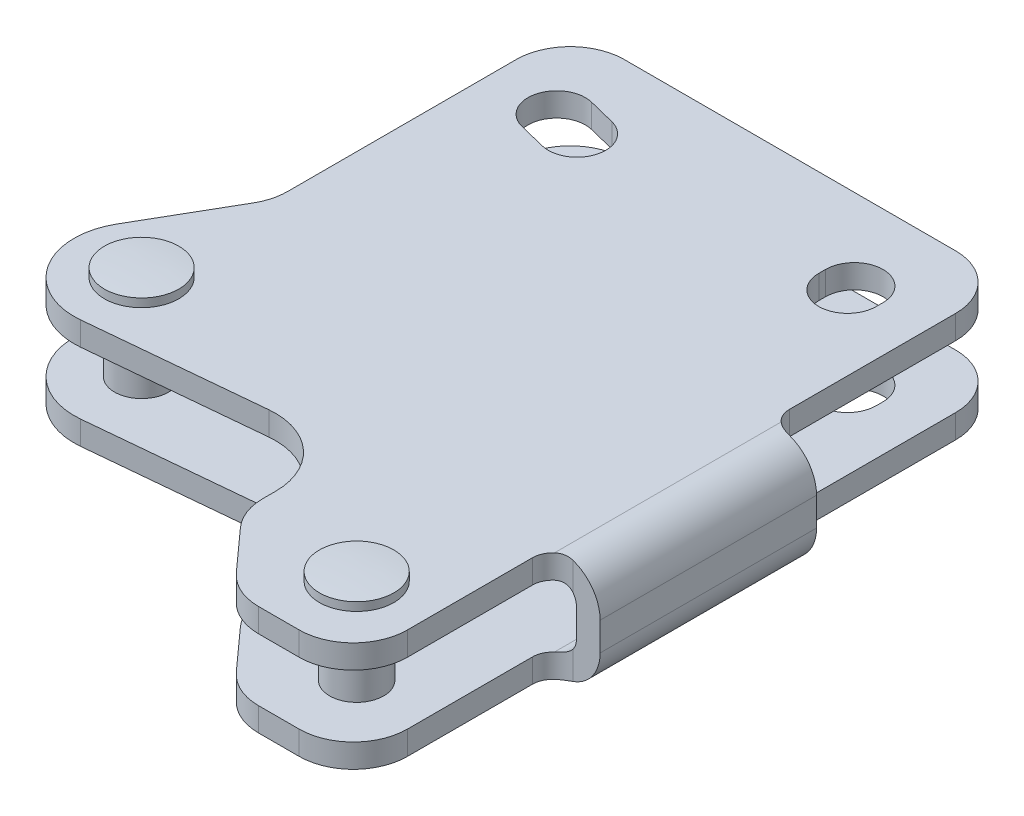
ISO-10303-21;
HEADER;
FILE_DESCRIPTION(('STEP AP214'),'2;1');
FILE_NAME('part.step','',(''),(''),'','','');
FILE_SCHEMA(('AUTOMOTIVE_DESIGN { 1 0 10303 214 1 1 1 1 }'));
ENDSEC;
DATA;
#1=APPLICATION_CONTEXT('core data for automotive mechanical design processes');
#2=APPLICATION_PROTOCOL_DEFINITION('international standard','automotive_design',2000,#1);
#3=PRODUCT_CONTEXT('',#1,'mechanical');
#4=PRODUCT('Part','Part','',(#3));
#5=PRODUCT_RELATED_PRODUCT_CATEGORY('part','',(#4));
#6=PRODUCT_DEFINITION_FORMATION('','',#4);
#7=PRODUCT_DEFINITION_CONTEXT('part definition',#1,'design');
#8=PRODUCT_DEFINITION('design','',#6,#7);
#9=PRODUCT_DEFINITION_SHAPE('','',#8);
#10=(LENGTH_UNIT() NAMED_UNIT(*) SI_UNIT(.MILLI.,.METRE.));
#11=(NAMED_UNIT(*) PLANE_ANGLE_UNIT() SI_UNIT($,.RADIAN.));
#12=(NAMED_UNIT(*) SI_UNIT($,.STERADIAN.) SOLID_ANGLE_UNIT());
#13=UNCERTAINTY_MEASURE_WITH_UNIT(LENGTH_MEASURE(1.E-05),#10,'distance_accuracy_value','');
#14=(GEOMETRIC_REPRESENTATION_CONTEXT(3) GLOBAL_UNCERTAINTY_ASSIGNED_CONTEXT((#13)) GLOBAL_UNIT_ASSIGNED_CONTEXT((#10,
#11,#12)) REPRESENTATION_CONTEXT('',''));
#15=CARTESIAN_POINT('',(0.,0.,0.));
#16=DIRECTION('',(0.,0.,1.));
#17=DIRECTION('',(1.,0.,0.));
#18=AXIS2_PLACEMENT_3D('',#15,#16,#17);
#19=CARTESIAN_POINT('',(5.030776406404,8.1,-3.1231056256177));
#20=DIRECTION('',(-0.242535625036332,0.,0.970142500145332));
#21=DIRECTION('',(0.970142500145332,0.,0.242535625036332));
#22=AXIS2_PLACEMENT_3D('',#19,#20,#21);
#23=PLANE('',#22);
#24=DIRECTION('',(0.,-1.,0.));
#25=VECTOR('',#24,1.);
#26=CARTESIAN_POINT('',(1.030776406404,8.1,-4.1231056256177));
#27=LINE('',#26,#25);
#28=CARTESIAN_POINT('',(1.030776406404,8.1,-4.1231056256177));
#29=VERTEX_POINT('',#28);
#30=CARTESIAN_POINT('',(1.030776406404,4.6,-4.1231056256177));
#31=VERTEX_POINT('',#30);
#32=EDGE_CURVE('E775',#29,#31,#27,.T.);
#33=ORIENTED_EDGE('',*,*,#32,.T.);
#34=DIRECTION('',(0.970142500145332,0.,0.242535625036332));
#35=VECTOR('',#34,1.);
#36=CARTESIAN_POINT('',(5.030776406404,4.6,-3.1231056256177));
#37=LINE('',#36,#35);
#38=CARTESIAN_POINT('',(5.030776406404,4.6,-3.12310562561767));
#39=VERTEX_POINT('',#38);
#40=EDGE_CURVE('E31',#31,#39,#37,.T.);
#41=ORIENTED_EDGE('',*,*,#40,.T.);
#42=DIRECTION('',(0.,-1.,0.));
#43=VECTOR('',#42,1.);
#44=CARTESIAN_POINT('',(5.030776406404,8.1,-3.1231056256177));
#45=LINE('',#44,#43);
#46=CARTESIAN_POINT('',(5.030776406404,8.1,-3.1231056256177));
#47=VERTEX_POINT('',#46);
#48=EDGE_CURVE('E777',#47,#39,#45,.T.);
#49=ORIENTED_EDGE('',*,*,#48,.F.);
#50=DIRECTION('',(-0.970142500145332,0.,-0.242535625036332));
#51=VECTOR('',#50,1.);
#52=CARTESIAN_POINT('',(5.030776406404,8.1,-3.1231056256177));
#53=LINE('',#52,#51);
#54=EDGE_CURVE('E764',#47,#29,#53,.T.);
#55=ORIENTED_EDGE('',*,*,#54,.T.);
#56=EDGE_LOOP('',(#33,#41,#49,#55));
#57=FACE_BOUND('',#56,.T.);
#58=ADVANCED_FACE('F14',(#57),#23,.T.);
#59=CARTESIAN_POINT('',(4.,8.1,1.00000000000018));
#60=DIRECTION('',(0.,-1.,0.));
#61=DIRECTION('',(1.,0.,0.));
#62=AXIS2_PLACEMENT_3D('',#59,#60,#61);
#63=CYLINDRICAL_SURFACE('',#62,4.25000000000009);
#64=ORIENTED_EDGE('',*,*,#48,.T.);
#65=CARTESIAN_POINT('',(4.,4.6,1.00000000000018));
#66=DIRECTION('',(0.,-1.,0.));
#67=DIRECTION('',(1.,0.,0.));
#68=AXIS2_PLACEMENT_3D('',#65,#66,#67);
#69=CIRCLE('',#68,4.25000000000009);
#70=CARTESIAN_POINT('',(2.969223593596,4.6,5.123105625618));
#71=VERTEX_POINT('',#70);
#72=EDGE_CURVE('E1045',#39,#71,#69,.T.);
#73=ORIENTED_EDGE('',*,*,#72,.T.);
#74=DIRECTION('',(0.,-1.,0.));
#75=VECTOR('',#74,1.);
#76=CARTESIAN_POINT('',(2.969223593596,8.1,5.123105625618));
#77=LINE('',#76,#75);
#78=CARTESIAN_POINT('',(2.969223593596,8.1,5.123105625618));
#79=VERTEX_POINT('',#78);
#80=EDGE_CURVE('E780',#79,#71,#77,.T.);
#81=ORIENTED_EDGE('',*,*,#80,.F.);
#82=CARTESIAN_POINT('',(4.,8.1,1.00000000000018));
#83=DIRECTION('',(0.,1.,0.));
#84=DIRECTION('',(-1.,0.,0.));
#85=AXIS2_PLACEMENT_3D('',#82,#83,#84);
#86=CIRCLE('',#85,4.25000000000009);
#87=EDGE_CURVE('E762',#79,#47,#86,.T.);
#88=ORIENTED_EDGE('',*,*,#87,.T.);
#89=EDGE_LOOP('',(#64,#73,#81,#88));
#90=FACE_BOUND('',#89,.T.);
#91=ADVANCED_FACE('F514',(#90),#63,.F.);
#92=CARTESIAN_POINT('',(-1.030776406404,8.1,4.123105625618));
#93=DIRECTION('',(0.242535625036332,0.,-0.970142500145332));
#94=DIRECTION('',(-0.970142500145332,0.,-0.242535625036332));
#95=AXIS2_PLACEMENT_3D('',#92,#93,#94);
#96=PLANE('',#95);
#97=ORIENTED_EDGE('',*,*,#80,.T.);
#98=DIRECTION('',(-0.970142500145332,0.,-0.242535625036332));
#99=VECTOR('',#98,1.);
#100=CARTESIAN_POINT('',(-1.030776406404,4.6,4.123105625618));
#101=LINE('',#100,#99);
#102=CARTESIAN_POINT('',(-1.030776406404,4.6,4.12310562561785));
#103=VERTEX_POINT('',#102);
#104=EDGE_CURVE('E1042',#71,#103,#101,.T.);
#105=ORIENTED_EDGE('',*,*,#104,.T.);
#106=DIRECTION('',(0.,-1.,0.));
#107=VECTOR('',#106,1.);
#108=CARTESIAN_POINT('',(-1.030776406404,8.1,4.123105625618));
#109=LINE('',#108,#107);
#110=CARTESIAN_POINT('',(-1.030776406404,8.1,4.123105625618));
#111=VERTEX_POINT('',#110);
#112=EDGE_CURVE('E770',#111,#103,#109,.T.);
#113=ORIENTED_EDGE('',*,*,#112,.F.);
#114=DIRECTION('',(0.970142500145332,0.,0.242535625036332));
#115=VECTOR('',#114,1.);
#116=CARTESIAN_POINT('',(-1.030776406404,8.1,4.123105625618));
#117=LINE('',#116,#115);
#118=EDGE_CURVE('E765',#111,#79,#117,.T.);
#119=ORIENTED_EDGE('',*,*,#118,.T.);
#120=EDGE_LOOP('',(#97,#105,#113,#119));
#121=FACE_BOUND('',#120,.T.);
#122=ADVANCED_FACE('F521',(#121),#96,.T.);
#123=CARTESIAN_POINT('',(0.,8.1,0.));
#124=DIRECTION('',(0.,-1.,0.));
#125=DIRECTION('',(1.,0.,0.));
#126=AXIS2_PLACEMENT_3D('',#123,#124,#125);
#127=CYLINDRICAL_SURFACE('',#126,4.25000000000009);
#128=ORIENTED_EDGE('',*,*,#112,.T.);
#129=CARTESIAN_POINT('',(0.,4.6,0.));
#130=DIRECTION('',(0.,-1.,0.));
#131=DIRECTION('',(1.,0.,0.));
#132=AXIS2_PLACEMENT_3D('',#129,#130,#131);
#133=CIRCLE('',#132,4.25000000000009);
#134=EDGE_CURVE('E1040',#103,#31,#133,.T.);
#135=ORIENTED_EDGE('',*,*,#134,.T.);
#136=ORIENTED_EDGE('',*,*,#32,.F.);
#137=CARTESIAN_POINT('',(0.,8.1,0.));
#138=DIRECTION('',(0.,1.,0.));
#139=DIRECTION('',(1.,0.,0.));
#140=AXIS2_PLACEMENT_3D('',#137,#138,#139);
#141=CIRCLE('',#140,4.25000000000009);
#142=EDGE_CURVE('E768',#29,#111,#141,.T.);
#143=ORIENTED_EDGE('',*,*,#142,.T.);
#144=EDGE_LOOP('',(#128,#135,#136,#143));
#145=FACE_BOUND('',#144,.T.);
#146=ADVANCED_FACE('F526',(#145),#127,.F.);
#147=CARTESIAN_POINT('',(58.,-8.1,20.5800000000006));
#148=DIRECTION('',(0.,1.,0.));
#149=DIRECTION('',(-1.,0.,0.));
#150=AXIS2_PLACEMENT_3D('',#147,#148,#149);
#151=CYLINDRICAL_SURFACE('',#150,2.9999999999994);
#152=CARTESIAN_POINT('',(58.,3.60000000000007,23.58));
#153=CARTESIAN_POINT('',(57.9632486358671,3.64901351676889,23.5799992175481));
#154=CARTESIAN_POINT('',(57.9246792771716,3.69667449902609,23.579324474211));
#155=CARTESIAN_POINT('',(57.844159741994,3.78902975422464,23.5762209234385));
#156=CARTESIAN_POINT('',(57.8022078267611,3.83372247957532,23.5737912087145));
#157=CARTESIAN_POINT('',(57.7151078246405,3.91993628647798,23.5667619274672));
#158=CARTESIAN_POINT('',(57.6699519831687,3.96144912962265,23.5621569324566));
#159=CARTESIAN_POINT('',(57.5769328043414,4.04088425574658,23.5503902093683));
#160=CARTESIAN_POINT('',(57.5290699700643,4.07880720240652,23.5432289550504));
#161=CARTESIAN_POINT('',(57.3816130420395,4.18710172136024,23.5172675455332));
#162=CARTESIAN_POINT('',(57.2784303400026,4.25172332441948,23.4940069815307));
#163=CARTESIAN_POINT('',(57.0673593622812,4.36384806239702,23.4334524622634));
#164=CARTESIAN_POINT('',(56.9594827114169,4.41139105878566,23.3961916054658));
#165=CARTESIAN_POINT('',(56.7505183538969,4.48711346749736,23.309613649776));
#166=CARTESIAN_POINT('',(56.6494258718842,4.51631364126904,23.2611909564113));
#167=CARTESIAN_POINT('',(56.4510342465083,4.56108192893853,23.1516814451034));
#168=CARTESIAN_POINT('',(56.3537390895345,4.57663606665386,23.0905817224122));
#169=CARTESIAN_POINT('',(56.2148075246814,4.59117137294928,22.9916771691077));
#170=CARTESIAN_POINT('',(56.1704377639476,4.59456370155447,22.9581923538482));
#171=CARTESIAN_POINT('',(56.0837102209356,4.59897300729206,22.8888741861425));
#172=CARTESIAN_POINT('',(56.0413457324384,4.59999854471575,22.8530497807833));
#173=CARTESIAN_POINT('',(56.,4.6,22.8160679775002));
#174=B_SPLINE_CURVE_WITH_KNOTS('',3,(#152,#153,#154,#155,#156,#157,#158,#159,#160,#161,#162,
#163,#164,#165,#166,#167,#168,#169,#170,#171,#172,#173),.UNSPECIFIED.,.F.,.F.,(4,2,2,2,2,2,2,2,
2,2,4),(0.,0.183751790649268,0.367598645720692,0.551906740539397,0.736180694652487,
1.10589263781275,1.47473597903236,1.82062950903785,2.16687688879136,2.33383524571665,
2.50018878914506),.UNSPECIFIED.);
#175=CARTESIAN_POINT('',(58.,3.60000000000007,23.58));
#176=VERTEX_POINT('',#175);
#177=CARTESIAN_POINT('',(56.,4.6,22.8160679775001));
#178=VERTEX_POINT('',#177);
#179=EDGE_CURVE('E449',#176,#178,#174,.T.);
#180=ORIENTED_EDGE('',*,*,#179,.T.);
#181=CARTESIAN_POINT('',(58.,4.6,20.5800000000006));
#182=DIRECTION('',(0.,1.,0.));
#183=DIRECTION('',(1.,0.,0.));
#184=AXIS2_PLACEMENT_3D('',#181,#182,#183);
#185=CIRCLE('',#184,2.99999999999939);
#186=CARTESIAN_POINT('',(55.,4.6,20.58));
#187=VERTEX_POINT('',#186);
#188=EDGE_CURVE('E428',#187,#178,#185,.T.);
#189=ORIENTED_EDGE('',*,*,#188,.F.);
#190=DIRECTION('',(0.,1.,0.));
#191=VECTOR('',#190,1.);
#192=CARTESIAN_POINT('',(55.,-8.1,20.58));
#193=LINE('',#192,#191);
#194=CARTESIAN_POINT('',(55.,8.1,20.58));
#195=VERTEX_POINT('',#194);
#196=EDGE_CURVE('E728',#187,#195,#193,.T.);
#197=ORIENTED_EDGE('',*,*,#196,.T.);
#198=CARTESIAN_POINT('',(58.,8.1,20.5800000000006));
#199=DIRECTION('',(0.,-1.,0.));
#200=DIRECTION('',(1.,0.,0.));
#201=AXIS2_PLACEMENT_3D('',#198,#199,#200);
#202=CIRCLE('',#201,2.9999999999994);
#203=CARTESIAN_POINT('',(56.,8.1,22.8160679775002));
#204=VERTEX_POINT('',#203);
#205=EDGE_CURVE('E938',#204,#195,#202,.T.);
#206=ORIENTED_EDGE('',*,*,#205,.F.);
#207=CARTESIAN_POINT('',(56.,8.1,22.8160679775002));
#208=CARTESIAN_POINT('',(56.0584219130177,8.10000452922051,22.8683350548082));
#209=CARTESIAN_POINT('',(56.1189088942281,8.09914681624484,22.9183012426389));
#210=CARTESIAN_POINT('',(56.243577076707,8.09537709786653,23.0133328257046));
#211=CARTESIAN_POINT('',(56.3077590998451,8.09246463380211,23.0583971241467));
#212=CARTESIAN_POINT('',(56.4393382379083,8.08425635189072,23.1432915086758));
#213=CARTESIAN_POINT('',(56.5067345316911,8.07896113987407,23.1831229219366));
#214=CARTESIAN_POINT('',(56.6442006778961,8.06571751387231,23.2572965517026));
#215=CARTESIAN_POINT('',(56.7142701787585,8.05776944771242,23.2916394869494));
#216=CARTESIAN_POINT('',(56.9279732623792,8.02954006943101,23.3862414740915));
#217=CARTESIAN_POINT('',(57.0749362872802,8.0048824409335,23.4379676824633));
#218=CARTESIAN_POINT('',(57.3723064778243,7.94292599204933,23.5176293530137));
#219=CARTESIAN_POINT('',(57.522707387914,7.90564865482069,23.5456049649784));
#220=CARTESIAN_POINT('',(57.7273252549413,7.84627315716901,23.5680968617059));
#221=CARTESIAN_POINT('',(57.7821713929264,7.8295002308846,23.572583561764));
#222=CARTESIAN_POINT('',(57.8914299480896,7.7943630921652,23.5785318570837));
#223=CARTESIAN_POINT('',(57.9458428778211,7.77600121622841,23.5799978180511));
#224=CARTESIAN_POINT('',(58.,7.75685424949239,23.58));
#225=B_SPLINE_CURVE_WITH_KNOTS('',3,(#207,#208,#209,#210,#211,#212,#213,#214,#215,#216,#217,
#218,#219,#220,#221,#222,#223,#224),.UNSPECIFIED.,.F.,.F.,(4,2,2,2,2,2,2,2,4),(0.,
0.235111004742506,0.470274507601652,0.705378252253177,0.940451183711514,1.41117862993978,
1.88110872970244,2.05361661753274,2.22587501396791),.UNSPECIFIED.);
#226=CARTESIAN_POINT('',(58.,7.7568542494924,23.58));
#227=VERTEX_POINT('',#226);
#228=EDGE_CURVE('E623',#204,#227,#225,.T.);
#229=ORIENTED_EDGE('',*,*,#228,.T.);
#230=DIRECTION('',(0.,1.,0.));
#231=VECTOR('',#230,1.);
#232=CARTESIAN_POINT('',(58.,-8.1,23.58));
#233=LINE('',#232,#231);
#234=EDGE_CURVE('E732',#176,#227,#233,.T.);
#235=ORIENTED_EDGE('',*,*,#234,.F.);
#236=EDGE_LOOP('',(#180,#189,#197,#206,#229,#235));
#237=FACE_BOUND('',#236,.T.);
#238=ADVANCED_FACE('F607',(#237),#151,.F.);
#239=CARTESIAN_POINT('',(55.,-8.1,20.58));
#240=DIRECTION('',(1.,0.,0.));
#241=DIRECTION('',(0.,1.,0.));
#242=AXIS2_PLACEMENT_3D('',#239,#240,#241);
#243=PLANE('',#242);
#244=ORIENTED_EDGE('',*,*,#196,.F.);
#245=DIRECTION('',(0.,0.,1.));
#246=VECTOR('',#245,1.);
#247=CARTESIAN_POINT('',(55.,4.6,-4.));
#248=LINE('',#247,#246);
#249=CARTESIAN_POINT('',(55.,4.6,-4.));
#250=VERTEX_POINT('',#249);
#251=EDGE_CURVE('E1029',#250,#187,#248,.T.);
#252=ORIENTED_EDGE('',*,*,#251,.F.);
#253=DIRECTION('',(0.,1.,0.));
#254=VECTOR('',#253,1.);
#255=CARTESIAN_POINT('',(55.,-8.1,-4.));
#256=LINE('',#255,#254);
#257=CARTESIAN_POINT('',(55.,8.1,-4.));
#258=VERTEX_POINT('',#257);
#259=EDGE_CURVE('E724',#250,#258,#256,.T.);
#260=ORIENTED_EDGE('',*,*,#259,.T.);
#261=DIRECTION('',(0.,0.,-1.));
#262=VECTOR('',#261,1.);
#263=CARTESIAN_POINT('',(55.,8.1,20.58));
#264=LINE('',#263,#262);
#265=EDGE_CURVE('E942',#195,#258,#264,.T.);
#266=ORIENTED_EDGE('',*,*,#265,.F.);
#267=EDGE_LOOP('',(#244,#252,#260,#266));
#268=FACE_BOUND('',#267,.T.);
#269=ADVANCED_FACE('F611',(#268),#243,.T.);
#270=CARTESIAN_POINT('',(47.,-8.1,-4.));
#271=DIRECTION('',(0.,1.,0.));
#272=DIRECTION('',(-1.,0.,0.));
#273=AXIS2_PLACEMENT_3D('',#270,#271,#272);
#274=CYLINDRICAL_SURFACE('',#273,8.);
#275=ORIENTED_EDGE('',*,*,#259,.F.);
#276=CARTESIAN_POINT('',(47.,4.6,-4.));
#277=DIRECTION('',(0.,-1.,0.));
#278=DIRECTION('',(1.,0.,0.));
#279=AXIS2_PLACEMENT_3D('',#276,#277,#278);
#280=CIRCLE('',#279,8.);
#281=CARTESIAN_POINT('',(47.,4.6,-12.));
#282=VERTEX_POINT('',#281);
#283=EDGE_CURVE('E1027',#282,#250,#280,.T.);
#284=ORIENTED_EDGE('',*,*,#283,.F.);
#285=DIRECTION('',(0.,1.,0.));
#286=VECTOR('',#285,1.);
#287=CARTESIAN_POINT('',(47.,-8.1,-12.));
#288=LINE('',#287,#286);
#289=CARTESIAN_POINT('',(47.,8.1,-12.));
#290=VERTEX_POINT('',#289);
#291=EDGE_CURVE('E720',#282,#290,#288,.T.);
#292=ORIENTED_EDGE('',*,*,#291,.T.);
#293=CARTESIAN_POINT('',(47.,8.1,-4.));
#294=DIRECTION('',(0.,1.,0.));
#295=DIRECTION('',(-1.,0.,0.));
#296=AXIS2_PLACEMENT_3D('',#293,#294,#295);
#297=CIRCLE('',#296,8.);
#298=EDGE_CURVE('E945',#258,#290,#297,.T.);
#299=ORIENTED_EDGE('',*,*,#298,.F.);
#300=EDGE_LOOP('',(#275,#284,#292,#299));
#301=FACE_BOUND('',#300,.T.);
#302=ADVANCED_FACE('F1778',(#301),#274,.T.);
#303=CARTESIAN_POINT('',(47.,-8.1,-12.));
#304=DIRECTION('',(0.,0.,-1.));
#305=DIRECTION('',(0.,-1.,0.));
#306=AXIS2_PLACEMENT_3D('',#303,#304,#305);
#307=PLANE('',#306);
#308=ORIENTED_EDGE('',*,*,#291,.F.);
#309=DIRECTION('',(1.,0.,0.));
#310=VECTOR('',#309,1.);
#311=CARTESIAN_POINT('',(-2.,4.6,-11.9999999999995));
#312=LINE('',#311,#310);
#313=CARTESIAN_POINT('',(-2.,4.6,-11.9999999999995));
#314=VERTEX_POINT('',#313);
#315=EDGE_CURVE('E1025',#314,#282,#312,.T.);
#316=ORIENTED_EDGE('',*,*,#315,.F.);
#317=DIRECTION('',(0.,1.,0.));
#318=VECTOR('',#317,1.);
#319=CARTESIAN_POINT('',(-2.,-8.1,-12.));
#320=LINE('',#319,#318);
#321=CARTESIAN_POINT('',(-2.,8.1,-12.));
#322=VERTEX_POINT('',#321);
#323=EDGE_CURVE('E716',#314,#322,#320,.T.);
#324=ORIENTED_EDGE('',*,*,#323,.T.);
#325=DIRECTION('',(-1.,0.,0.));
#326=VECTOR('',#325,1.);
#327=CARTESIAN_POINT('',(47.,8.1,-12.));
#328=LINE('',#327,#326);
#329=EDGE_CURVE('E950',#290,#322,#328,.T.);
#330=ORIENTED_EDGE('',*,*,#329,.F.);
#331=EDGE_LOOP('',(#308,#316,#324,#330));
#332=FACE_BOUND('',#331,.T.);
#333=ADVANCED_FACE('F1766',(#332),#307,.T.);
#334=CARTESIAN_POINT('',(-2.,-8.1,-3.99999999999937));
#335=DIRECTION('',(0.,1.,0.));
#336=DIRECTION('',(-1.,0.,0.));
#337=AXIS2_PLACEMENT_3D('',#334,#335,#336);
#338=CYLINDRICAL_SURFACE('',#337,8.00000000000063);
#339=ORIENTED_EDGE('',*,*,#323,.F.);
#340=CARTESIAN_POINT('',(-2.,4.6,-3.99999999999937));
#341=DIRECTION('',(0.,-1.,0.));
#342=DIRECTION('',(1.,0.,0.));
#343=AXIS2_PLACEMENT_3D('',#340,#341,#342);
#344=CIRCLE('',#343,8.00000000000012);
#345=CARTESIAN_POINT('',(-10.,4.6,-3.99999999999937));
#346=VERTEX_POINT('',#345);
#347=EDGE_CURVE('E1023',#346,#314,#344,.T.);
#348=ORIENTED_EDGE('',*,*,#347,.F.);
#349=DIRECTION('',(0.,1.,0.));
#350=VECTOR('',#349,1.);
#351=CARTESIAN_POINT('',(-10.,-8.1,-3.99999999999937));
#352=LINE('',#351,#350);
#353=CARTESIAN_POINT('',(-10.,8.1,-3.99999999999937));
#354=VERTEX_POINT('',#353);
#355=EDGE_CURVE('E712',#346,#354,#352,.T.);
#356=ORIENTED_EDGE('',*,*,#355,.T.);
#357=CARTESIAN_POINT('',(-2.,8.1,-3.99999999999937));
#358=DIRECTION('',(0.,1.,0.));
#359=DIRECTION('',(1.,0.,0.));
#360=AXIS2_PLACEMENT_3D('',#357,#358,#359);
#361=CIRCLE('',#360,8.00000000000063);
#362=EDGE_CURVE('E953',#322,#354,#361,.T.);
#363=ORIENTED_EDGE('',*,*,#362,.F.);
#364=EDGE_LOOP('',(#339,#348,#356,#363));
#365=FACE_BOUND('',#364,.T.);
#366=ADVANCED_FACE('F1753',(#365),#338,.T.);
#367=CARTESIAN_POINT('',(-10.,-8.1,-4.));
#368=DIRECTION('',(-1.,0.,0.));
#369=DIRECTION('',(0.,-1.,0.));
#370=AXIS2_PLACEMENT_3D('',#367,#368,#369);
#371=PLANE('',#370);
#372=ORIENTED_EDGE('',*,*,#355,.F.);
#373=DIRECTION('',(0.,0.,-1.));
#374=VECTOR('',#373,1.);
#375=CARTESIAN_POINT('',(-10.,4.6,29.7828166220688));
#376=LINE('',#375,#374);
#377=CARTESIAN_POINT('',(-10.,4.6,29.7828166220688));
#378=VERTEX_POINT('',#377);
#379=EDGE_CURVE('E1021',#378,#346,#376,.T.);
#380=ORIENTED_EDGE('',*,*,#379,.F.);
#381=DIRECTION('',(0.,1.,0.));
#382=VECTOR('',#381,1.);
#383=CARTESIAN_POINT('',(-10.,-8.1,29.782816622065));
#384=LINE('',#383,#382);
#385=CARTESIAN_POINT('',(-10.,8.1,29.782816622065));
#386=VERTEX_POINT('',#385);
#387=EDGE_CURVE('E708',#378,#386,#384,.T.);
#388=ORIENTED_EDGE('',*,*,#387,.T.);
#389=DIRECTION('',(0.,0.,1.));
#390=VECTOR('',#389,1.);
#391=CARTESIAN_POINT('',(-10.,8.1,-4.));
#392=LINE('',#391,#390);
#393=EDGE_CURVE('E956',#354,#386,#392,.T.);
#394=ORIENTED_EDGE('',*,*,#393,.F.);
#395=EDGE_LOOP('',(#372,#380,#388,#394));
#396=FACE_BOUND('',#395,.T.);
#397=ADVANCED_FACE('F1740',(#396),#371,.T.);
#398=CARTESIAN_POINT('',(-17.9999999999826,-8.1,29.7828166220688));
#399=DIRECTION('',(0.,1.,0.));
#400=DIRECTION('',(-1.,0.,0.));
#401=AXIS2_PLACEMENT_3D('',#398,#399,#400);
#402=CYLINDRICAL_SURFACE('',#401,7.99999999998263);
#403=ORIENTED_EDGE('',*,*,#387,.F.);
#404=CARTESIAN_POINT('',(-17.9999999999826,4.6,29.7828166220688));
#405=DIRECTION('',(0.,1.,0.));
#406=DIRECTION('',(1.,0.,0.));
#407=AXIS2_PLACEMENT_3D('',#404,#405,#406);
#408=CIRCLE('',#407,7.9999999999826);
#409=CARTESIAN_POINT('',(-11.071796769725,4.6,33.782816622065));
#410=VERTEX_POINT('',#409);
#411=EDGE_CURVE('E1019',#410,#378,#408,.T.);
#412=ORIENTED_EDGE('',*,*,#411,.F.);
#413=DIRECTION('',(0.,1.,0.));
#414=VECTOR('',#413,1.);
#415=CARTESIAN_POINT('',(-11.071796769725,-8.1,33.782816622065));
#416=LINE('',#415,#414);
#417=CARTESIAN_POINT('',(-11.071796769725,8.1,33.782816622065));
#418=VERTEX_POINT('',#417);
#419=EDGE_CURVE('E704',#410,#418,#416,.T.);
#420=ORIENTED_EDGE('',*,*,#419,.T.);
#421=CARTESIAN_POINT('',(-17.9999999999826,8.1,29.7828166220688));
#422=DIRECTION('',(0.,-1.,0.));
#423=DIRECTION('',(-1.,0.,0.));
#424=AXIS2_PLACEMENT_3D('',#421,#422,#423);
#425=CIRCLE('',#424,7.99999999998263);
#426=EDGE_CURVE('E959',#386,#418,#425,.T.);
#427=ORIENTED_EDGE('',*,*,#426,.F.);
#428=EDGE_LOOP('',(#403,#412,#420,#427));
#429=FACE_BOUND('',#428,.T.);
#430=ADVANCED_FACE('F1727',(#429),#402,.F.);
#431=CARTESIAN_POINT('',(-11.071796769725,-8.1,33.782816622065));
#432=DIRECTION('',(-0.866025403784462,0.,-0.499999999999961));
#433=DIRECTION('',(-0.499999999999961,0.,0.866025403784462));
#434=AXIS2_PLACEMENT_3D('',#431,#432,#433);
#435=PLANE('',#434);
#436=ORIENTED_EDGE('',*,*,#419,.F.);
#437=DIRECTION('',(0.499999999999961,0.,-0.866025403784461));
#438=VECTOR('',#437,1.);
#439=CARTESIAN_POINT('',(-18.460254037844,4.6,46.58));
#440=LINE('',#439,#438);
#441=CARTESIAN_POINT('',(-18.460254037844,4.6,46.58));
#442=VERTEX_POINT('',#441);
#443=EDGE_CURVE('E1017',#442,#410,#440,.T.);
#444=ORIENTED_EDGE('',*,*,#443,.F.);
#445=DIRECTION('',(0.,1.,0.));
#446=VECTOR('',#445,1.);
#447=CARTESIAN_POINT('',(-18.460254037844,-8.1,46.58));
#448=LINE('',#447,#446);
#449=CARTESIAN_POINT('',(-18.460254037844,8.1,46.58));
#450=VERTEX_POINT('',#449);
#451=EDGE_CURVE('E700',#442,#450,#448,.T.);
#452=ORIENTED_EDGE('',*,*,#451,.T.);
#453=DIRECTION('',(-0.499999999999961,0.,0.866025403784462));
#454=VECTOR('',#453,1.);
#455=CARTESIAN_POINT('',(-11.071796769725,8.1,33.782816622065));
#456=LINE('',#455,#454);
#457=EDGE_CURVE('E962',#418,#450,#456,.T.);
#458=ORIENTED_EDGE('',*,*,#457,.F.);
#459=EDGE_LOOP('',(#436,#444,#452,#458));
#460=FACE_BOUND('',#459,.T.);
#461=ADVANCED_FACE('F1714',(#460),#435,.T.);
#462=CARTESIAN_POINT('',(-9.8,-8.1,51.58));
#463=DIRECTION('',(0.,1.,0.));
#464=DIRECTION('',(-1.,0.,0.));
#465=AXIS2_PLACEMENT_3D('',#462,#463,#464);
#466=CYLINDRICAL_SURFACE('',#465,9.99999999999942);
#467=ORIENTED_EDGE('',*,*,#451,.F.);
#468=CARTESIAN_POINT('',(-9.8,4.6,51.58));
#469=DIRECTION('',(0.,-1.,0.));
#470=DIRECTION('',(1.,0.,0.));
#471=AXIS2_PLACEMENT_3D('',#468,#469,#470);
#472=CIRCLE('',#471,9.99999999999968);
#473=CARTESIAN_POINT('',(-8.855598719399,4.6,61.535305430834));
#474=VERTEX_POINT('',#473);
#475=EDGE_CURVE('E1015',#474,#442,#472,.T.);
#476=ORIENTED_EDGE('',*,*,#475,.F.);
#477=DIRECTION('',(0.,1.,0.));
#478=VECTOR('',#477,1.);
#479=CARTESIAN_POINT('',(-8.855598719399,-8.1,61.535305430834));
#480=LINE('',#479,#478);
#481=CARTESIAN_POINT('',(-8.855598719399,8.1,61.535305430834));
#482=VERTEX_POINT('',#481);
#483=EDGE_CURVE('E696',#474,#482,#480,.T.);
#484=ORIENTED_EDGE('',*,*,#483,.T.);
#485=CARTESIAN_POINT('',(-9.8,8.1,51.58));
#486=DIRECTION('',(0.,1.,0.));
#487=DIRECTION('',(1.,0.,0.));
#488=AXIS2_PLACEMENT_3D('',#485,#486,#487);
#489=CIRCLE('',#488,9.99999999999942);
#490=EDGE_CURVE('E965',#450,#482,#489,.T.);
#491=ORIENTED_EDGE('',*,*,#490,.F.);
#492=EDGE_LOOP('',(#467,#476,#484,#491));
#493=FACE_BOUND('',#492,.T.);
#494=ADVANCED_FACE('F1701',(#493),#466,.T.);
#495=CARTESIAN_POINT('',(-8.855598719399,-8.1,61.535305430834));
#496=DIRECTION('',(0.0944401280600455,0.,0.995530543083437));
#497=DIRECTION('',(0.995530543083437,0.,-0.0944401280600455));
#498=AXIS2_PLACEMENT_3D('',#495,#496,#497);
#499=PLANE('',#498);
#500=ORIENTED_EDGE('',*,*,#483,.F.);
#501=DIRECTION('',(-0.995530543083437,0.,0.0944401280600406));
#502=VECTOR('',#501,1.);
#503=CARTESIAN_POINT('',(16.555598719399,4.6,59.1246945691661));
#504=LINE('',#503,#502);
#505=CARTESIAN_POINT('',(16.555598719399,4.6,59.1246945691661));
#506=VERTEX_POINT('',#505);
#507=EDGE_CURVE('E1013',#506,#474,#504,.T.);
#508=ORIENTED_EDGE('',*,*,#507,.F.);
#509=DIRECTION('',(0.,1.,0.));
#510=VECTOR('',#509,1.);
#511=CARTESIAN_POINT('',(16.555598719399,-8.1,59.124694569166));
#512=LINE('',#511,#510);
#513=CARTESIAN_POINT('',(16.555598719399,8.1,59.124694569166));
#514=VERTEX_POINT('',#513);
#515=EDGE_CURVE('E692',#506,#514,#512,.T.);
#516=ORIENTED_EDGE('',*,*,#515,.T.);
#517=DIRECTION('',(0.995530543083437,0.,-0.0944401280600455));
#518=VECTOR('',#517,1.);
#519=CARTESIAN_POINT('',(-8.855598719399,8.1,61.535305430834));
#520=LINE('',#519,#518);
#521=EDGE_CURVE('E968',#482,#514,#520,.T.);
#522=ORIENTED_EDGE('',*,*,#521,.F.);
#523=EDGE_LOOP('',(#500,#508,#516,#522));
#524=FACE_BOUND('',#523,.T.);
#525=ADVANCED_FACE('F1688',(#524),#499,.T.);
#526=CARTESIAN_POINT('',(17.5000000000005,-8.1,69.08));
#527=DIRECTION('',(0.,1.,0.));
#528=DIRECTION('',(-1.,0.,0.));
#529=AXIS2_PLACEMENT_3D('',#526,#527,#528);
#530=CYLINDRICAL_SURFACE('',#529,9.99999999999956);
#531=ORIENTED_EDGE('',*,*,#515,.F.);
#532=CARTESIAN_POINT('',(17.5000000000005,4.6,69.08));
#533=DIRECTION('',(0.,1.,0.));
#534=DIRECTION('',(1.,0.,0.));
#535=AXIS2_PLACEMENT_3D('',#532,#533,#534);
#536=CIRCLE('',#535,9.9999999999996);
#537=CARTESIAN_POINT('',(27.5,4.6,69.08));
#538=VERTEX_POINT('',#537);
#539=EDGE_CURVE('E1011',#538,#506,#536,.T.);
#540=ORIENTED_EDGE('',*,*,#539,.F.);
#541=DIRECTION('',(0.,1.,0.));
#542=VECTOR('',#541,1.);
#543=CARTESIAN_POINT('',(27.5,-8.1,69.08));
#544=LINE('',#543,#542);
#545=CARTESIAN_POINT('',(27.5,8.1,69.08));
#546=VERTEX_POINT('',#545);
#547=EDGE_CURVE('E688',#538,#546,#544,.T.);
#548=ORIENTED_EDGE('',*,*,#547,.T.);
#549=CARTESIAN_POINT('',(17.5000000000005,8.1,69.08));
#550=DIRECTION('',(0.,-1.,0.));
#551=DIRECTION('',(-1.,0.,0.));
#552=AXIS2_PLACEMENT_3D('',#549,#550,#551);
#553=CIRCLE('',#552,9.99999999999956);
#554=EDGE_CURVE('E971',#514,#546,#553,.T.);
#555=ORIENTED_EDGE('',*,*,#554,.F.);
#556=EDGE_LOOP('',(#531,#540,#548,#555));
#557=FACE_BOUND('',#556,.T.);
#558=ADVANCED_FACE('F1675',(#557),#530,.F.);
#559=CARTESIAN_POINT('',(27.5,-8.1,69.08));
#560=DIRECTION('',(-1.,0.,0.));
#561=DIRECTION('',(0.,-1.,0.));
#562=AXIS2_PLACEMENT_3D('',#559,#560,#561);
#563=PLANE('',#562);
#564=ORIENTED_EDGE('',*,*,#547,.F.);
#565=DIRECTION('',(0.,0.,-1.));
#566=VECTOR('',#565,1.);
#567=CARTESIAN_POINT('',(27.5,4.6,70.971631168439));
#568=LINE('',#567,#566);
#569=CARTESIAN_POINT('',(27.5,4.6,70.971631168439));
#570=VERTEX_POINT('',#569);
#571=EDGE_CURVE('E1009',#570,#538,#568,.T.);
#572=ORIENTED_EDGE('',*,*,#571,.F.);
#573=DIRECTION('',(0.,1.,0.));
#574=VECTOR('',#573,1.);
#575=CARTESIAN_POINT('',(27.5,-8.1,70.971631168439));
#576=LINE('',#575,#574);
#577=CARTESIAN_POINT('',(27.5,8.1,70.971631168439));
#578=VERTEX_POINT('',#577);
#579=EDGE_CURVE('E684',#570,#578,#576,.T.);
#580=ORIENTED_EDGE('',*,*,#579,.T.);
#581=DIRECTION('',(0.,0.,1.));
#582=VECTOR('',#581,1.);
#583=CARTESIAN_POINT('',(27.5,8.1,69.08));
#584=LINE('',#583,#582);
#585=EDGE_CURVE('E974',#546,#578,#584,.T.);
#586=ORIENTED_EDGE('',*,*,#585,.F.);
#587=EDGE_LOOP('',(#564,#572,#580,#586));
#588=FACE_BOUND('',#587,.T.);
#589=ADVANCED_FACE('F1662',(#588),#563,.T.);
#590=CARTESIAN_POINT('',(35.4999999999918,-8.1,70.9716311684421));
#591=DIRECTION('',(0.,1.,0.));
#592=DIRECTION('',(-1.,0.,0.));
#593=AXIS2_PLACEMENT_3D('',#590,#591,#592);
#594=CYLINDRICAL_SURFACE('',#593,7.99999999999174);
#595=ORIENTED_EDGE('',*,*,#579,.F.);
#596=CARTESIAN_POINT('',(35.4999999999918,4.6,70.9716311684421));
#597=DIRECTION('',(0.,-1.,0.));
#598=DIRECTION('',(1.,0.,0.));
#599=AXIS2_PLACEMENT_3D('',#596,#597,#598);
#600=CIRCLE('',#599,7.99999999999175);
#601=CARTESIAN_POINT('',(29.554841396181,4.6,76.32467601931));
#602=VERTEX_POINT('',#601);
#603=EDGE_CURVE('E1007',#602,#570,#600,.T.);
#604=ORIENTED_EDGE('',*,*,#603,.F.);
#605=DIRECTION('',(0.,1.,0.));
#606=VECTOR('',#605,1.);
#607=CARTESIAN_POINT('',(29.554841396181,-8.1,76.32467601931));
#608=LINE('',#607,#606);
#609=CARTESIAN_POINT('',(29.554841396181,8.1,76.32467601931));
#610=VERTEX_POINT('',#609);
#611=EDGE_CURVE('E680',#602,#610,#608,.T.);
#612=ORIENTED_EDGE('',*,*,#611,.T.);
#613=CARTESIAN_POINT('',(35.4999999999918,8.1,70.9716311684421));
#614=DIRECTION('',(0.,1.,0.));
#615=DIRECTION('',(-1.,0.,0.));
#616=AXIS2_PLACEMENT_3D('',#613,#614,#615);
#617=CIRCLE('',#616,7.99999999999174);
#618=EDGE_CURVE('E977',#578,#610,#617,.T.);
#619=ORIENTED_EDGE('',*,*,#618,.F.);
#620=EDGE_LOOP('',(#595,#604,#612,#619));
#621=FACE_BOUND('',#620,.T.);
#622=ADVANCED_FACE('F1649',(#621),#594,.T.);
#623=CARTESIAN_POINT('',(29.554841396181,-8.1,76.32467601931));
#624=DIRECTION('',(-0.743144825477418,0.,0.669130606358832));
#625=DIRECTION('',(0.669130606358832,0.,0.743144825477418));
#626=AXIS2_PLACEMENT_3D('',#623,#624,#625);
#627=PLANE('',#626);
#628=ORIENTED_EDGE('',*,*,#611,.F.);
#629=DIRECTION('',(-0.669130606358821,0.,-0.743144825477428));
#630=VECTOR('',#629,1.);
#631=CARTESIAN_POINT('',(35.054841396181,4.6,82.4330448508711));
#632=LINE('',#631,#630);
#633=CARTESIAN_POINT('',(35.054841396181,4.6,82.4330448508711));
#634=VERTEX_POINT('',#633);
#635=EDGE_CURVE('E1005',#634,#602,#632,.T.);
#636=ORIENTED_EDGE('',*,*,#635,.F.);
#637=DIRECTION('',(0.,1.,0.));
#638=VECTOR('',#637,1.);
#639=CARTESIAN_POINT('',(35.054841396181,-8.1,82.433044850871));
#640=LINE('',#639,#638);
#641=CARTESIAN_POINT('',(35.054841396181,8.1,82.433044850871));
#642=VERTEX_POINT('',#641);
#643=EDGE_CURVE('E676',#634,#642,#640,.T.);
#644=ORIENTED_EDGE('',*,*,#643,.T.);
#645=DIRECTION('',(0.669130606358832,0.,0.743144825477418));
#646=VECTOR('',#645,1.);
#647=CARTESIAN_POINT('',(29.554841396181,8.1,76.32467601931));
#648=LINE('',#647,#646);
#649=EDGE_CURVE('E980',#610,#642,#648,.T.);
#650=ORIENTED_EDGE('',*,*,#649,.F.);
#651=EDGE_LOOP('',(#628,#636,#644,#650));
#652=FACE_BOUND('',#651,.T.);
#653=ADVANCED_FACE('F1636',(#652),#627,.T.);
#654=CARTESIAN_POINT('',(41.,-8.1,77.08));
#655=DIRECTION('',(0.,1.,0.));
#656=DIRECTION('',(-1.,0.,0.));
#657=AXIS2_PLACEMENT_3D('',#654,#655,#656);
#658=CYLINDRICAL_SURFACE('',#657,7.99999999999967);
#659=ORIENTED_EDGE('',*,*,#643,.F.);
#660=CARTESIAN_POINT('',(41.,4.6,77.08));
#661=DIRECTION('',(0.,-1.,0.));
#662=DIRECTION('',(1.,0.,0.));
#663=AXIS2_PLACEMENT_3D('',#660,#661,#662);
#664=CIRCLE('',#663,8.);
#665=CARTESIAN_POINT('',(41.,4.6,85.08));
#666=VERTEX_POINT('',#665);
#667=EDGE_CURVE('E1003',#666,#634,#664,.T.);
#668=ORIENTED_EDGE('',*,*,#667,.F.);
#669=DIRECTION('',(0.,1.,0.));
#670=VECTOR('',#669,1.);
#671=CARTESIAN_POINT('',(41.,-8.1,85.08));
#672=LINE('',#671,#670);
#673=CARTESIAN_POINT('',(41.,8.1,85.08));
#674=VERTEX_POINT('',#673);
#675=EDGE_CURVE('E672',#666,#674,#672,.T.);
#676=ORIENTED_EDGE('',*,*,#675,.T.);
#677=CARTESIAN_POINT('',(41.,8.1,77.08));
#678=DIRECTION('',(0.,1.,0.));
#679=DIRECTION('',(-1.,0.,0.));
#680=AXIS2_PLACEMENT_3D('',#677,#678,#679);
#681=CIRCLE('',#680,7.99999999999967);
#682=EDGE_CURVE('E983',#642,#674,#681,.T.);
#683=ORIENTED_EDGE('',*,*,#682,.F.);
#684=EDGE_LOOP('',(#659,#668,#676,#683));
#685=FACE_BOUND('',#684,.T.);
#686=ADVANCED_FACE('F1623',(#685),#658,.T.);
#687=CARTESIAN_POINT('',(41.,-8.1,85.08));
#688=DIRECTION('',(0.,0.,1.));
#689=DIRECTION('',(0.,1.,0.));
#690=AXIS2_PLACEMENT_3D('',#687,#688,#689);
#691=PLANE('',#690);
#692=ORIENTED_EDGE('',*,*,#675,.F.);
#693=DIRECTION('',(-1.,0.,0.));
#694=VECTOR('',#693,1.);
#695=CARTESIAN_POINT('',(47.,4.6,85.08));
#696=LINE('',#695,#694);
#697=CARTESIAN_POINT('',(47.,4.6,85.08));
#698=VERTEX_POINT('',#697);
#699=EDGE_CURVE('E998',#698,#666,#696,.T.);
#700=ORIENTED_EDGE('',*,*,#699,.F.);
#701=DIRECTION('',(0.,1.,0.));
#702=VECTOR('',#701,1.);
#703=CARTESIAN_POINT('',(47.,-8.1,85.08));
#704=LINE('',#703,#702);
#705=CARTESIAN_POINT('',(47.,8.1,85.08));
#706=VERTEX_POINT('',#705);
#707=EDGE_CURVE('E668',#698,#706,#704,.T.);
#708=ORIENTED_EDGE('',*,*,#707,.T.);
#709=DIRECTION('',(1.,0.,0.));
#710=VECTOR('',#709,1.);
#711=CARTESIAN_POINT('',(41.,8.1,85.08));
#712=LINE('',#711,#710);
#713=EDGE_CURVE('E986',#674,#706,#712,.T.);
#714=ORIENTED_EDGE('',*,*,#713,.F.);
#715=EDGE_LOOP('',(#692,#700,#708,#714));
#716=FACE_BOUND('',#715,.T.);
#717=ADVANCED_FACE('F1610',(#716),#691,.T.);
#718=CARTESIAN_POINT('',(46.9999999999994,-8.1,77.08));
#719=DIRECTION('',(0.,1.,0.));
#720=DIRECTION('',(-1.,0.,0.));
#721=AXIS2_PLACEMENT_3D('',#718,#719,#720);
#722=CYLINDRICAL_SURFACE('',#721,8.00000000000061);
#723=ORIENTED_EDGE('',*,*,#707,.F.);
#724=CARTESIAN_POINT('',(46.9999999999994,4.6,77.08));
#725=DIRECTION('',(0.,-1.,0.));
#726=DIRECTION('',(1.,0.,0.));
#727=AXIS2_PLACEMENT_3D('',#724,#725,#726);
#728=CIRCLE('',#727,8.00000000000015);
#729=CARTESIAN_POINT('',(55.,4.6,77.08));
#730=VERTEX_POINT('',#729);
#731=EDGE_CURVE('E996',#730,#698,#728,.T.);
#732=ORIENTED_EDGE('',*,*,#731,.F.);
#733=DIRECTION('',(0.,1.,0.));
#734=VECTOR('',#733,1.);
#735=CARTESIAN_POINT('',(55.,-8.1,77.08));
#736=LINE('',#735,#734);
#737=CARTESIAN_POINT('',(55.,8.1,77.08));
#738=VERTEX_POINT('',#737);
#739=EDGE_CURVE('E664',#730,#738,#736,.T.);
#740=ORIENTED_EDGE('',*,*,#739,.T.);
#741=CARTESIAN_POINT('',(46.9999999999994,8.1,77.08));
#742=DIRECTION('',(0.,1.,0.));
#743=DIRECTION('',(-1.,0.,0.));
#744=AXIS2_PLACEMENT_3D('',#741,#742,#743);
#745=CIRCLE('',#744,8.00000000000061);
#746=EDGE_CURVE('E880',#706,#738,#745,.T.);
#747=ORIENTED_EDGE('',*,*,#746,.F.);
#748=EDGE_LOOP('',(#723,#732,#740,#747));
#749=FACE_BOUND('',#748,.T.);
#750=ADVANCED_FACE('F1597',(#749),#722,.T.);
#751=CARTESIAN_POINT('',(55.,-8.1,77.08));
#752=DIRECTION('',(1.,0.,0.));
#753=DIRECTION('',(0.,1.,0.));
#754=AXIS2_PLACEMENT_3D('',#751,#752,#753);
#755=PLANE('',#754);
#756=ORIENTED_EDGE('',*,*,#739,.F.);
#757=DIRECTION('',(0.,0.,1.));
#758=VECTOR('',#757,1.);
#759=CARTESIAN_POINT('',(55.,4.6,58.58));
#760=LINE('',#759,#758);
#761=CARTESIAN_POINT('',(55.,4.6,58.58));
#762=VERTEX_POINT('',#761);
#763=EDGE_CURVE('E444',#762,#730,#760,.T.);
#764=ORIENTED_EDGE('',*,*,#763,.F.);
#765=DIRECTION('',(0.,1.,0.));
#766=VECTOR('',#765,1.);
#767=CARTESIAN_POINT('',(55.,-8.1,58.58));
#768=LINE('',#767,#766);
#769=CARTESIAN_POINT('',(55.,8.1,58.58));
#770=VERTEX_POINT('',#769);
#771=EDGE_CURVE('E443',#762,#770,#768,.T.);
#772=ORIENTED_EDGE('',*,*,#771,.T.);
#773=DIRECTION('',(0.,0.,-1.));
#774=VECTOR('',#773,1.);
#775=CARTESIAN_POINT('',(55.,8.1,77.08));
#776=LINE('',#775,#774);
#777=EDGE_CURVE('E875',#738,#770,#776,.T.);
#778=ORIENTED_EDGE('',*,*,#777,.F.);
#779=EDGE_LOOP('',(#756,#764,#772,#778));
#780=FACE_BOUND('',#779,.T.);
#781=ADVANCED_FACE('F994',(#780),#755,.T.);
#782=CARTESIAN_POINT('',(58.,-8.1,58.58));
#783=DIRECTION('',(0.,1.,0.));
#784=DIRECTION('',(-1.,0.,0.));
#785=AXIS2_PLACEMENT_3D('',#782,#783,#784);
#786=CYLINDRICAL_SURFACE('',#785,2.99999999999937);
#787=ORIENTED_EDGE('',*,*,#771,.F.);
#788=CARTESIAN_POINT('',(58.,4.6,58.58));
#789=DIRECTION('',(0.,1.,0.));
#790=DIRECTION('',(1.,0.,0.));
#791=AXIS2_PLACEMENT_3D('',#788,#789,#790);
#792=CIRCLE('',#791,2.99999999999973);
#793=CARTESIAN_POINT('',(56.,4.6,56.3439320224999));
#794=VERTEX_POINT('',#793);
#795=EDGE_CURVE('E425',#794,#762,#792,.T.);
#796=ORIENTED_EDGE('',*,*,#795,.F.);
#797=CARTESIAN_POINT('',(56.,4.6,56.3439320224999));
#798=CARTESIAN_POINT('',(56.0455675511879,4.60000339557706,56.3031631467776));
#799=CARTESIAN_POINT('',(56.0924053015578,4.59875376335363,56.2637900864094));
#800=CARTESIAN_POINT('',(56.1883239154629,4.59335912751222,56.1880229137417));
#801=CARTESIAN_POINT('',(56.2374063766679,4.58921203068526,56.1516309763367));
#802=CARTESIAN_POINT('',(56.3375453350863,4.5776210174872,56.0820068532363));
#803=CARTESIAN_POINT('',(56.3886054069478,4.57017084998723,56.0487808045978));
#804=CARTESIAN_POINT('',(56.4921359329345,4.55164738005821,55.9857703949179));
#805=CARTESIAN_POINT('',(56.5446060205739,4.5405750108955,55.9559851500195));
#806=CARTESIAN_POINT('',(56.703946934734,4.50133447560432,55.8717436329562));
#807=CARTESIAN_POINT('',(56.812339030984,4.46718415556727,55.8226838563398));
#808=CARTESIAN_POINT('',(57.0278323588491,4.38187696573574,55.7395362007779));
#809=CARTESIAN_POINT('',(57.1349358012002,4.33075550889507,55.7054174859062));
#810=CARTESIAN_POINT('',(57.336342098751,4.21583449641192,55.6525953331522));
#811=CARTESIAN_POINT('',(57.4310237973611,4.15308615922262,55.6330277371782));
#812=CARTESIAN_POINT('',(57.6119320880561,4.0143335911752,55.6037918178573));
#813=CARTESIAN_POINT('',(57.6981517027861,3.93831856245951,55.5941316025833));
#814=CARTESIAN_POINT('',(57.8185437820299,3.81642524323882,55.5852261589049));
#815=CARTESIAN_POINT('',(57.8569435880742,3.77480442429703,55.5831837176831));
#816=CARTESIAN_POINT('',(57.9307295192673,3.68917052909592,55.5805743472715));
#817=CARTESIAN_POINT('',(57.9661253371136,3.64516596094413,55.5800024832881));
#818=CARTESIAN_POINT('',(58.,3.60000000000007,55.58));
#819=B_SPLINE_CURVE_WITH_KNOTS('',3,(#797,#798,#799,#800,#801,#802,#803,#804,#805,#806,#807,
#808,#809,#810,#811,#812,#813,#814,#815,#816,#817,#818),.UNSPECIFIED.,.F.,.F.,(4,2,2,2,2,2,2,2,
2,2,4),(0.,0.183411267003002,0.36695517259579,0.550847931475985,0.734693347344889,
1.10386105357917,1.47226322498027,1.81650693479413,2.16103214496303,2.33090354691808,
2.5002041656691),.UNSPECIFIED.);
#820=CARTESIAN_POINT('',(58.,3.60000000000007,55.58));
#821=VERTEX_POINT('',#820);
#822=EDGE_CURVE('E440',#794,#821,#819,.T.);
#823=ORIENTED_EDGE('',*,*,#822,.T.);
#824=DIRECTION('',(0.,1.,0.));
#825=VECTOR('',#824,1.);
#826=CARTESIAN_POINT('',(58.,-8.1,55.58));
#827=LINE('',#826,#825);
#828=CARTESIAN_POINT('',(58.,7.75685424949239,55.58));
#829=VERTEX_POINT('',#828);
#830=EDGE_CURVE('E655',#821,#829,#827,.T.);
#831=ORIENTED_EDGE('',*,*,#830,.T.);
#832=CARTESIAN_POINT('',(58.,7.7568542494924,55.58));
#833=CARTESIAN_POINT('',(57.9260936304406,7.78299724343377,55.5799896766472));
#834=CARTESIAN_POINT('',(57.8516567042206,7.80767217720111,55.5827312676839));
#835=CARTESIAN_POINT('',(57.7022452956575,7.85399352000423,55.5938753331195));
#836=CARTESIAN_POINT('',(57.6272706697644,7.87563908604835,55.60227937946));
#837=CARTESIAN_POINT('',(57.4773834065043,7.91578546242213,55.6249004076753));
#838=CARTESIAN_POINT('',(57.4024707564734,7.93428770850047,55.6391147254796));
#839=CARTESIAN_POINT('',(57.253308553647,7.96814093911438,55.6734011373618));
#840=CARTESIAN_POINT('',(57.1790589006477,7.98349240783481,55.6934723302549));
#841=CARTESIAN_POINT('',(56.9578837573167,8.02493801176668,55.76258665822));
#842=CARTESIAN_POINT('',(56.8127341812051,8.04637017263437,55.8205007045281));
#843=CARTESIAN_POINT('',(56.5325397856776,8.07798464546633,55.9587530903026));
#844=CARTESIAN_POINT('',(56.3974787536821,8.0881853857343,56.0390544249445));
#845=CARTESIAN_POINT('',(56.2225815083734,8.09605575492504,56.1625414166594));
#846=CARTESIAN_POINT('',(56.1765844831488,8.09757025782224,56.197046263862));
#847=CARTESIAN_POINT('',(56.0866999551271,8.09954111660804,56.2686000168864));
#848=CARTESIAN_POINT('',(56.0428094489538,8.09999902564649,56.3056451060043));
#849=CARTESIAN_POINT('',(56.,8.1,56.3439320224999));
#850=B_SPLINE_CURVE_WITH_KNOTS('',3,(#832,#833,#834,#835,#836,#837,#838,#839,#840,#841,#842,
#843,#844,#845,#846,#847,#848,#849),.UNSPECIFIED.,.F.,.F.,(4,2,2,2,2,2,2,2,4),(0.,
0.235132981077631,0.470331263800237,0.705421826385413,0.940476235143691,1.41120993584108,
1.88117010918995,2.05365151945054,2.22587922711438),.UNSPECIFIED.);
#851=CARTESIAN_POINT('',(56.,8.1,56.3439320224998));
#852=VERTEX_POINT('',#851);
#853=EDGE_CURVE('E632',#829,#852,#850,.T.);
#854=ORIENTED_EDGE('',*,*,#853,.T.);
#855=CARTESIAN_POINT('',(58.,8.1,58.58));
#856=DIRECTION('',(0.,-1.,0.));
#857=DIRECTION('',(-1.,0.,0.));
#858=AXIS2_PLACEMENT_3D('',#855,#856,#857);
#859=CIRCLE('',#858,2.99999999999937);
#860=EDGE_CURVE('E865',#770,#852,#859,.T.);
#861=ORIENTED_EDGE('',*,*,#860,.F.);
#862=EDGE_LOOP('',(#787,#796,#823,#831,#854,#861));
#863=FACE_BOUND('',#862,.T.);
#864=ADVANCED_FACE('F438',(#863),#786,.F.);
#865=CARTESIAN_POINT('',(44.,8.1,0.));
#866=DIRECTION('',(0.,-1.,0.));
#867=DIRECTION('',(1.,0.,0.));
#868=AXIS2_PLACEMENT_3D('',#865,#866,#867);
#869=CYLINDRICAL_SURFACE('',#868,4.25);
#870=DIRECTION('',(0.,-1.,0.));
#871=VECTOR('',#870,1.);
#872=CARTESIAN_POINT('',(39.75,8.1,0.));
#873=LINE('',#872,#871);
#874=CARTESIAN_POINT('',(39.75,8.1,0.));
#875=VERTEX_POINT('',#874);
#876=CARTESIAN_POINT('',(39.75,4.6,0.));
#877=VERTEX_POINT('',#876);
#878=EDGE_CURVE('E819',#875,#877,#873,.T.);
#879=ORIENTED_EDGE('',*,*,#878,.T.);
#880=CARTESIAN_POINT('',(44.,4.6,0.));
#881=DIRECTION('',(0.,-1.,0.));
#882=DIRECTION('',(1.,0.,0.));
#883=AXIS2_PLACEMENT_3D('',#880,#881,#882);
#884=CIRCLE('',#883,4.25);
#885=CARTESIAN_POINT('',(48.25,4.6,0.));
#886=VERTEX_POINT('',#885);
#887=EDGE_CURVE('E39',#877,#886,#884,.T.);
#888=ORIENTED_EDGE('',*,*,#887,.T.);
#889=DIRECTION('',(0.,-1.,0.));
#890=VECTOR('',#889,1.);
#891=CARTESIAN_POINT('',(48.25,8.1,0.));
#892=LINE('',#891,#890);
#893=CARTESIAN_POINT('',(48.25,8.1,0.));
#894=VERTEX_POINT('',#893);
#895=EDGE_CURVE('E822',#894,#886,#892,.T.);
#896=ORIENTED_EDGE('',*,*,#895,.F.);
#897=CARTESIAN_POINT('',(44.,8.1,0.));
#898=DIRECTION('',(0.,1.,0.));
#899=DIRECTION('',(1.,0.,0.));
#900=AXIS2_PLACEMENT_3D('',#897,#898,#899);
#901=CIRCLE('',#900,4.25);
#902=EDGE_CURVE('E810',#894,#875,#901,.T.);
#903=ORIENTED_EDGE('',*,*,#902,.T.);
#904=EDGE_LOOP('',(#879,#888,#896,#903));
#905=FACE_BOUND('',#904,.T.);
#906=ADVANCED_FACE('F556',(#905),#869,.F.);
#907=CARTESIAN_POINT('',(48.25,8.1,1.));
#908=DIRECTION('',(-1.,0.,0.));
#909=DIRECTION('',(0.,-1.,0.));
#910=AXIS2_PLACEMENT_3D('',#907,#908,#909);
#911=PLANE('',#910);
#912=ORIENTED_EDGE('',*,*,#895,.T.);
#913=DIRECTION('',(0.,0.,1.));
#914=VECTOR('',#913,1.);
#915=CARTESIAN_POINT('',(48.25,4.6,1.));
#916=LINE('',#915,#914);
#917=CARTESIAN_POINT('',(48.25,4.6,1.));
#918=VERTEX_POINT('',#917);
#919=EDGE_CURVE('E1036',#886,#918,#916,.T.);
#920=ORIENTED_EDGE('',*,*,#919,.T.);
#921=DIRECTION('',(0.,-1.,0.));
#922=VECTOR('',#921,1.);
#923=CARTESIAN_POINT('',(48.25,8.1,1.));
#924=LINE('',#923,#922);
#925=CARTESIAN_POINT('',(48.25,8.1,1.));
#926=VERTEX_POINT('',#925);
#927=EDGE_CURVE('E825',#926,#918,#924,.T.);
#928=ORIENTED_EDGE('',*,*,#927,.F.);
#929=DIRECTION('',(0.,0.,-1.));
#930=VECTOR('',#929,1.);
#931=CARTESIAN_POINT('',(48.25,8.1,1.));
#932=LINE('',#931,#930);
#933=EDGE_CURVE('E808',#926,#894,#932,.T.);
#934=ORIENTED_EDGE('',*,*,#933,.T.);
#935=EDGE_LOOP('',(#912,#920,#928,#934));
#936=FACE_BOUND('',#935,.T.);
#937=ADVANCED_FACE('F559',(#936),#911,.T.);
#938=CARTESIAN_POINT('',(44.,8.1,1.));
#939=DIRECTION('',(0.,-1.,0.));
#940=DIRECTION('',(1.,0.,0.));
#941=AXIS2_PLACEMENT_3D('',#938,#939,#940);
#942=CYLINDRICAL_SURFACE('',#941,4.25);
#943=ORIENTED_EDGE('',*,*,#927,.T.);
#944=CARTESIAN_POINT('',(44.,4.6,1.));
#945=DIRECTION('',(0.,-1.,0.));
#946=DIRECTION('',(1.,0.,0.));
#947=AXIS2_PLACEMENT_3D('',#944,#945,#946);
#948=CIRCLE('',#947,4.25);
#949=CARTESIAN_POINT('',(39.75,4.6,1.));
#950=VERTEX_POINT('',#949);
#951=EDGE_CURVE('E1033',#918,#950,#948,.T.);
#952=ORIENTED_EDGE('',*,*,#951,.T.);
#953=DIRECTION('',(0.,-1.,0.));
#954=VECTOR('',#953,1.);
#955=CARTESIAN_POINT('',(39.75,8.1,1.));
#956=LINE('',#955,#954);
#957=CARTESIAN_POINT('',(39.75,8.1,1.));
#958=VERTEX_POINT('',#957);
#959=EDGE_CURVE('E815',#958,#950,#956,.T.);
#960=ORIENTED_EDGE('',*,*,#959,.F.);
#961=CARTESIAN_POINT('',(44.,8.1,1.));
#962=DIRECTION('',(0.,1.,0.));
#963=DIRECTION('',(-1.,0.,0.));
#964=AXIS2_PLACEMENT_3D('',#961,#962,#963);
#965=CIRCLE('',#964,4.25);
#966=EDGE_CURVE('E807',#958,#926,#965,.T.);
#967=ORIENTED_EDGE('',*,*,#966,.T.);
#968=EDGE_LOOP('',(#943,#952,#960,#967));
#969=FACE_BOUND('',#968,.T.);
#970=ADVANCED_FACE('F554',(#969),#942,.F.);
#971=CARTESIAN_POINT('',(39.75,8.1,0.));
#972=DIRECTION('',(1.,0.,0.));
#973=DIRECTION('',(0.,1.,0.));
#974=AXIS2_PLACEMENT_3D('',#971,#972,#973);
#975=PLANE('',#974);
#976=ORIENTED_EDGE('',*,*,#959,.T.);
#977=DIRECTION('',(0.,0.,-1.));
#978=VECTOR('',#977,1.);
#979=CARTESIAN_POINT('',(39.75,4.6,0.));
#980=LINE('',#979,#978);
#981=EDGE_CURVE('E1031',#950,#877,#980,.T.);
#982=ORIENTED_EDGE('',*,*,#981,.T.);
#983=ORIENTED_EDGE('',*,*,#878,.F.);
#984=DIRECTION('',(0.,0.,1.));
#985=VECTOR('',#984,1.);
#986=CARTESIAN_POINT('',(39.75,8.1,0.));
#987=LINE('',#986,#985);
#988=EDGE_CURVE('E813',#875,#958,#987,.T.);
#989=ORIENTED_EDGE('',*,*,#988,.T.);
#990=EDGE_LOOP('',(#976,#982,#983,#989));
#991=FACE_BOUND('',#990,.T.);
#992=ADVANCED_FACE('F550',(#991),#975,.T.);
#993=CARTESIAN_POINT('',(55.,-8.1,20.58));
#994=VERTEX_POINT('',#993);
#995=CARTESIAN_POINT('',(55.,-4.6,20.58));
#996=VERTEX_POINT('',#995);
#997=EDGE_CURVE('E729',#994,#996,#193,.T.);
#998=ORIENTED_EDGE('',*,*,#997,.T.);
#999=CARTESIAN_POINT('',(58.,-4.6,20.5800000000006));
#1000=DIRECTION('',(0.,-1.,0.));
#1001=DIRECTION('',(-1.,0.,0.));
#1002=AXIS2_PLACEMENT_3D('',#999,#1000,#1001);
#1003=CIRCLE('',#1002,2.99999999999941);
#1004=CARTESIAN_POINT('',(56.,-4.6,22.8160679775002));
#1005=VERTEX_POINT('',#1004);
#1006=EDGE_CURVE('E1055',#1005,#996,#1003,.T.);
#1007=ORIENTED_EDGE('',*,*,#1006,.F.);
#1008=CARTESIAN_POINT('',(56.,-4.6,22.8160679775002));
#1009=CARTESIAN_POINT('',(56.0455675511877,-4.60000339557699,22.8568368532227));
#1010=CARTESIAN_POINT('',(56.0924053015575,-4.59875376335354,22.896209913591));
#1011=CARTESIAN_POINT('',(56.1883239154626,-4.59335912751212,22.9719770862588));
#1012=CARTESIAN_POINT('',(56.2374063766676,-4.58921203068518,23.0083690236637));
#1013=CARTESIAN_POINT('',(56.337545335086,-4.57762101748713,23.0779931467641));
#1014=CARTESIAN_POINT('',(56.3886054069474,-4.57017084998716,23.1112191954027));
#1015=CARTESIAN_POINT('',(56.4921359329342,-4.55164738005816,23.1742296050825));
#1016=CARTESIAN_POINT('',(56.5446060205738,-4.54057501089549,23.2040148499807));
#1017=CARTESIAN_POINT('',(56.7039469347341,-4.50133447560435,23.2882563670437));
#1018=CARTESIAN_POINT('',(56.8123390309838,-4.46718415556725,23.3373161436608));
#1019=CARTESIAN_POINT('',(57.0278323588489,-4.38187696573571,23.4204637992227));
#1020=CARTESIAN_POINT('',(57.1349358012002,-4.33075550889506,23.4545825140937));
#1021=CARTESIAN_POINT('',(57.3363420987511,-4.21583449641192,23.5074046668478));
#1022=CARTESIAN_POINT('',(57.431023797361,-4.15308615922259,23.5269722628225));
#1023=CARTESIAN_POINT('',(57.6119320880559,-4.01433359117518,23.5562081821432));
#1024=CARTESIAN_POINT('',(57.6981517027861,-3.93831856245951,23.5658683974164));
#1025=CARTESIAN_POINT('',(57.8185437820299,-3.8164252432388,23.5747738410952));
#1026=CARTESIAN_POINT('',(57.8569435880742,-3.77480442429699,23.5768162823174));
#1027=CARTESIAN_POINT('',(57.9307295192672,-3.68917052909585,23.5794256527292));
#1028=CARTESIAN_POINT('',(57.9661253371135,-3.64516596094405,23.5799975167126));
#1029=CARTESIAN_POINT('',(58.,-3.6,23.58));
#1030=B_SPLINE_CURVE_WITH_KNOTS('',3,(#1008,#1009,#1010,#1011,#1012,#1013,#1014,#1015,#1016,
#1017,#1018,#1019,#1020,#1021,#1022,#1023,#1024,#1025,#1026,#1027,#1028,#1029),.UNSPECIFIED.,
.F.,.F.,(4,2,2,2,2,2,2,2,2,2,4),(0.,0.183411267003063,0.366955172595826,0.550847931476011,
0.734693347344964,1.10386105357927,1.47226322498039,1.81650693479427,2.16103214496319,
2.33090354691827,2.50020416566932),.UNSPECIFIED.);
#1031=CARTESIAN_POINT('',(58.,-3.6,23.58));
#1032=VERTEX_POINT('',#1031);
#1033=EDGE_CURVE('E455',#1005,#1032,#1030,.T.);
#1034=ORIENTED_EDGE('',*,*,#1033,.T.);
#1035=CARTESIAN_POINT('',(58.,-7.7568542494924,23.58));
#1036=VERTEX_POINT('',#1035);
#1037=EDGE_CURVE('E733',#1036,#1032,#233,.T.);
#1038=ORIENTED_EDGE('',*,*,#1037,.F.);
#1039=CARTESIAN_POINT('',(58.,-7.7568542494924,23.58));
#1040=CARTESIAN_POINT('',(57.9260936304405,-7.78299724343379,23.5800103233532));
#1041=CARTESIAN_POINT('',(57.8516567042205,-7.80767217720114,23.5772687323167));
#1042=CARTESIAN_POINT('',(57.7022452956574,-7.85399352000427,23.5661246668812));
#1043=CARTESIAN_POINT('',(57.6272706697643,-7.87563908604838,23.5577206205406));
#1044=CARTESIAN_POINT('',(57.4773834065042,-7.91578546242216,23.5350995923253));
#1045=CARTESIAN_POINT('',(57.4024707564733,-7.9342877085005,23.5208852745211));
#1046=CARTESIAN_POINT('',(57.253308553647,-7.96814093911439,23.4865988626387));
#1047=CARTESIAN_POINT('',(57.1790589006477,-7.9834924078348,23.4665276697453));
#1048=CARTESIAN_POINT('',(56.9578837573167,-8.02493801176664,23.3974133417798));
#1049=CARTESIAN_POINT('',(56.8127341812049,-8.04637017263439,23.3394992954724));
#1050=CARTESIAN_POINT('',(56.5325397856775,-8.07798464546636,23.2012469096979));
#1051=CARTESIAN_POINT('',(56.3974787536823,-8.08818538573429,23.1209455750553));
#1052=CARTESIAN_POINT('',(56.2225815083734,-8.09605575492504,22.9974585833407));
#1053=CARTESIAN_POINT('',(56.1765844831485,-8.09757025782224,22.9629537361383));
#1054=CARTESIAN_POINT('',(56.0866999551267,-8.09954111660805,22.8913999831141));
#1055=CARTESIAN_POINT('',(56.0428094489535,-8.0999990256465,22.8543548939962));
#1056=CARTESIAN_POINT('',(56.,-8.1,22.8160679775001));
#1057=B_SPLINE_CURVE_WITH_KNOTS('',3,(#1039,#1040,#1041,#1042,#1043,#1044,#1045,#1046,#1047,
#1048,#1049,#1050,#1051,#1052,#1053,#1054,#1055,#1056),.UNSPECIFIED.,.F.,.F.,(4,2,2,2,2,2,2,2,
4),(0.,0.235132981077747,0.470331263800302,0.705421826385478,0.940476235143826,1.41120993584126,
1.88117010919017,2.05365151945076,2.22587922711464),.UNSPECIFIED.);
#1058=CARTESIAN_POINT('',(56.,-8.1,22.8160679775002));
#1059=VERTEX_POINT('',#1058);
#1060=EDGE_CURVE('E598',#1036,#1059,#1057,.T.);
#1061=ORIENTED_EDGE('',*,*,#1060,.T.);
#1062=CARTESIAN_POINT('',(58.,-8.1,20.5800000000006));
#1063=DIRECTION('',(0.,-1.,0.));
#1064=DIRECTION('',(1.,0.,0.));
#1065=AXIS2_PLACEMENT_3D('',#1062,#1063,#1064);
#1066=CIRCLE('',#1065,2.9999999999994);
#1067=EDGE_CURVE('E876',#1059,#994,#1066,.T.);
#1068=ORIENTED_EDGE('',*,*,#1067,.T.);
#1069=EDGE_LOOP('',(#998,#1007,#1034,#1038,#1061,#1068));
#1070=FACE_BOUND('',#1069,.T.);
#1071=ADVANCED_FACE('F553',(#1070),#151,.F.);
#1072=CARTESIAN_POINT('',(55.,-8.1,-4.));
#1073=VERTEX_POINT('',#1072);
#1074=CARTESIAN_POINT('',(55.,-4.6,-4.));
#1075=VERTEX_POINT('',#1074);
#1076=EDGE_CURVE('E725',#1073,#1075,#256,.T.);
#1077=ORIENTED_EDGE('',*,*,#1076,.T.);
#1078=DIRECTION('',(0.,0.,-1.));
#1079=VECTOR('',#1078,1.);
#1080=CARTESIAN_POINT('',(55.,-4.6,20.58));
#1081=LINE('',#1080,#1079);
#1082=EDGE_CURVE('E1057',#996,#1075,#1081,.T.);
#1083=ORIENTED_EDGE('',*,*,#1082,.F.);
#1084=ORIENTED_EDGE('',*,*,#997,.F.);
#1085=DIRECTION('',(0.,0.,-1.));
#1086=VECTOR('',#1085,1.);
#1087=CARTESIAN_POINT('',(55.,-8.1,20.58));
#1088=LINE('',#1087,#1086);
#1089=EDGE_CURVE('E878',#994,#1073,#1088,.T.);
#1090=ORIENTED_EDGE('',*,*,#1089,.T.);
#1091=EDGE_LOOP('',(#1077,#1083,#1084,#1090));
#1092=FACE_BOUND('',#1091,.T.);
#1093=ADVANCED_FACE('F1776',(#1092),#243,.T.);
#1094=CARTESIAN_POINT('',(47.,-8.1,-12.));
#1095=VERTEX_POINT('',#1094);
#1096=CARTESIAN_POINT('',(47.,-4.6,-12.));
#1097=VERTEX_POINT('',#1096);
#1098=EDGE_CURVE('E721',#1095,#1097,#288,.T.);
#1099=ORIENTED_EDGE('',*,*,#1098,.T.);
#1100=CARTESIAN_POINT('',(47.,-4.6,-4.));
#1101=DIRECTION('',(0.,1.,0.));
#1102=DIRECTION('',(-1.,0.,0.));
#1103=AXIS2_PLACEMENT_3D('',#1100,#1101,#1102);
#1104=CIRCLE('',#1103,8.);
#1105=EDGE_CURVE('E1059',#1075,#1097,#1104,.T.);
#1106=ORIENTED_EDGE('',*,*,#1105,.F.);
#1107=ORIENTED_EDGE('',*,*,#1076,.F.);
#1108=CARTESIAN_POINT('',(47.,-8.1,-4.));
#1109=DIRECTION('',(0.,1.,0.));
#1110=DIRECTION('',(-1.,0.,0.));
#1111=AXIS2_PLACEMENT_3D('',#1108,#1109,#1110);
#1112=CIRCLE('',#1111,8.);
#1113=EDGE_CURVE('E886',#1073,#1095,#1112,.T.);
#1114=ORIENTED_EDGE('',*,*,#1113,.T.);
#1115=EDGE_LOOP('',(#1099,#1106,#1107,#1114));
#1116=FACE_BOUND('',#1115,.T.);
#1117=ADVANCED_FACE('F1763',(#1116),#274,.T.);
#1118=CARTESIAN_POINT('',(-2.,-8.1,-12.));
#1119=VERTEX_POINT('',#1118);
#1120=CARTESIAN_POINT('',(-2.,-4.6,-11.9999999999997));
#1121=VERTEX_POINT('',#1120);
#1122=EDGE_CURVE('E717',#1119,#1121,#320,.T.);
#1123=ORIENTED_EDGE('',*,*,#1122,.T.);
#1124=DIRECTION('',(-1.,0.,0.));
#1125=VECTOR('',#1124,1.);
#1126=CARTESIAN_POINT('',(47.,-4.6,-12.));
#1127=LINE('',#1126,#1125);
#1128=EDGE_CURVE('E1061',#1097,#1121,#1127,.T.);
#1129=ORIENTED_EDGE('',*,*,#1128,.F.);
#1130=ORIENTED_EDGE('',*,*,#1098,.F.);
#1131=DIRECTION('',(-1.,0.,0.));
#1132=VECTOR('',#1131,1.);
#1133=CARTESIAN_POINT('',(47.,-8.1,-12.));
#1134=LINE('',#1133,#1132);
#1135=EDGE_CURVE('E888',#1095,#1119,#1134,.T.);
#1136=ORIENTED_EDGE('',*,*,#1135,.T.);
#1137=EDGE_LOOP('',(#1123,#1129,#1130,#1136));
#1138=FACE_BOUND('',#1137,.T.);
#1139=ADVANCED_FACE('F1750',(#1138),#307,.T.);
#1140=CARTESIAN_POINT('',(-10.,-8.1,-3.99999999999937));
#1141=VERTEX_POINT('',#1140);
#1142=CARTESIAN_POINT('',(-10.,-4.6,-3.99999999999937));
#1143=VERTEX_POINT('',#1142);
#1144=EDGE_CURVE('E713',#1141,#1143,#352,.T.);
#1145=ORIENTED_EDGE('',*,*,#1144,.T.);
#1146=CARTESIAN_POINT('',(-2.,-4.6,-3.99999999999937));
#1147=DIRECTION('',(0.,1.,0.));
#1148=DIRECTION('',(-1.,0.,0.));
#1149=AXIS2_PLACEMENT_3D('',#1146,#1147,#1148);
#1150=CIRCLE('',#1149,8.00000000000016);
#1151=EDGE_CURVE('E1063',#1121,#1143,#1150,.T.);
#1152=ORIENTED_EDGE('',*,*,#1151,.F.);
#1153=ORIENTED_EDGE('',*,*,#1122,.F.);
#1154=CARTESIAN_POINT('',(-2.,-8.1,-3.99999999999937));
#1155=DIRECTION('',(0.,1.,0.));
#1156=DIRECTION('',(1.,0.,0.));
#1157=AXIS2_PLACEMENT_3D('',#1154,#1155,#1156);
#1158=CIRCLE('',#1157,8.00000000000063);
#1159=EDGE_CURVE('E891',#1119,#1141,#1158,.T.);
#1160=ORIENTED_EDGE('',*,*,#1159,.T.);
#1161=EDGE_LOOP('',(#1145,#1152,#1153,#1160));
#1162=FACE_BOUND('',#1161,.T.);
#1163=ADVANCED_FACE('F1737',(#1162),#338,.T.);
#1164=CARTESIAN_POINT('',(-10.,-8.1,29.782816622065));
#1165=VERTEX_POINT('',#1164);
#1166=CARTESIAN_POINT('',(-10.,-4.6,29.782816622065));
#1167=VERTEX_POINT('',#1166);
#1168=EDGE_CURVE('E709',#1165,#1167,#384,.T.);
#1169=ORIENTED_EDGE('',*,*,#1168,.T.);
#1170=DIRECTION('',(0.,0.,1.));
#1171=VECTOR('',#1170,1.);
#1172=CARTESIAN_POINT('',(-10.,-4.6,-3.99999999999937));
#1173=LINE('',#1172,#1171);
#1174=EDGE_CURVE('E1065',#1143,#1167,#1173,.T.);
#1175=ORIENTED_EDGE('',*,*,#1174,.F.);
#1176=ORIENTED_EDGE('',*,*,#1144,.F.);
#1177=DIRECTION('',(0.,0.,1.));
#1178=VECTOR('',#1177,1.);
#1179=CARTESIAN_POINT('',(-10.,-8.1,-4.));
#1180=LINE('',#1179,#1178);
#1181=EDGE_CURVE('E894',#1141,#1165,#1180,.T.);
#1182=ORIENTED_EDGE('',*,*,#1181,.T.);
#1183=EDGE_LOOP('',(#1169,#1175,#1176,#1182));
#1184=FACE_BOUND('',#1183,.T.);
#1185=ADVANCED_FACE('F1724',(#1184),#371,.T.);
#1186=CARTESIAN_POINT('',(-11.071796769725,-8.1,33.782816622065));
#1187=VERTEX_POINT('',#1186);
#1188=CARTESIAN_POINT('',(-11.071796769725,-4.6,33.782816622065));
#1189=VERTEX_POINT('',#1188);
#1190=EDGE_CURVE('E705',#1187,#1189,#416,.T.);
#1191=ORIENTED_EDGE('',*,*,#1190,.T.);
#1192=CARTESIAN_POINT('',(-17.9999999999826,-4.6,29.7828166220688));
#1193=DIRECTION('',(0.,-1.,0.));
#1194=DIRECTION('',(-1.,0.,0.));
#1195=AXIS2_PLACEMENT_3D('',#1192,#1193,#1194);
#1196=CIRCLE('',#1195,7.9999999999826);
#1197=EDGE_CURVE('E1067',#1167,#1189,#1196,.T.);
#1198=ORIENTED_EDGE('',*,*,#1197,.F.);
#1199=ORIENTED_EDGE('',*,*,#1168,.F.);
#1200=CARTESIAN_POINT('',(-17.9999999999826,-8.1,29.7828166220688));
#1201=DIRECTION('',(0.,-1.,0.));
#1202=DIRECTION('',(-1.,0.,0.));
#1203=AXIS2_PLACEMENT_3D('',#1200,#1201,#1202);
#1204=CIRCLE('',#1203,7.99999999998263);
#1205=EDGE_CURVE('E897',#1165,#1187,#1204,.T.);
#1206=ORIENTED_EDGE('',*,*,#1205,.T.);
#1207=EDGE_LOOP('',(#1191,#1198,#1199,#1206));
#1208=FACE_BOUND('',#1207,.T.);
#1209=ADVANCED_FACE('F1711',(#1208),#402,.F.);
#1210=CARTESIAN_POINT('',(-18.460254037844,-8.1,46.58));
#1211=VERTEX_POINT('',#1210);
#1212=CARTESIAN_POINT('',(-18.460254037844,-4.6,46.58));
#1213=VERTEX_POINT('',#1212);
#1214=EDGE_CURVE('E701',#1211,#1213,#448,.T.);
#1215=ORIENTED_EDGE('',*,*,#1214,.T.);
#1216=DIRECTION('',(-0.499999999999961,0.,0.866025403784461));
#1217=VECTOR('',#1216,1.);
#1218=CARTESIAN_POINT('',(-11.071796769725,-4.6,33.782816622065));
#1219=LINE('',#1218,#1217);
#1220=EDGE_CURVE('E1069',#1189,#1213,#1219,.T.);
#1221=ORIENTED_EDGE('',*,*,#1220,.F.);
#1222=ORIENTED_EDGE('',*,*,#1190,.F.);
#1223=DIRECTION('',(-0.499999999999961,0.,0.866025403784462));
#1224=VECTOR('',#1223,1.);
#1225=CARTESIAN_POINT('',(-11.071796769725,-8.1,33.782816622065));
#1226=LINE('',#1225,#1224);
#1227=EDGE_CURVE('E900',#1187,#1211,#1226,.T.);
#1228=ORIENTED_EDGE('',*,*,#1227,.T.);
#1229=EDGE_LOOP('',(#1215,#1221,#1222,#1228));
#1230=FACE_BOUND('',#1229,.T.);
#1231=ADVANCED_FACE('F1698',(#1230),#435,.T.);
#1232=CARTESIAN_POINT('',(-8.855598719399,-8.1,61.535305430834));
#1233=VERTEX_POINT('',#1232);
#1234=CARTESIAN_POINT('',(-8.855598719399,-4.6,61.535305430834));
#1235=VERTEX_POINT('',#1234);
#1236=EDGE_CURVE('E697',#1233,#1235,#480,.T.);
#1237=ORIENTED_EDGE('',*,*,#1236,.T.);
#1238=CARTESIAN_POINT('',(-9.8,-4.6,51.58));
#1239=DIRECTION('',(0.,1.,0.));
#1240=DIRECTION('',(-1.,0.,0.));
#1241=AXIS2_PLACEMENT_3D('',#1238,#1239,#1240);
#1242=CIRCLE('',#1241,9.99999999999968);
#1243=EDGE_CURVE('E1071',#1213,#1235,#1242,.T.);
#1244=ORIENTED_EDGE('',*,*,#1243,.F.);
#1245=ORIENTED_EDGE('',*,*,#1214,.F.);
#1246=CARTESIAN_POINT('',(-9.8,-8.1,51.58));
#1247=DIRECTION('',(0.,1.,0.));
#1248=DIRECTION('',(1.,0.,0.));
#1249=AXIS2_PLACEMENT_3D('',#1246,#1247,#1248);
#1250=CIRCLE('',#1249,9.99999999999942);
#1251=EDGE_CURVE('E903',#1211,#1233,#1250,.T.);
#1252=ORIENTED_EDGE('',*,*,#1251,.T.);
#1253=EDGE_LOOP('',(#1237,#1244,#1245,#1252));
#1254=FACE_BOUND('',#1253,.T.);
#1255=ADVANCED_FACE('F1685',(#1254),#466,.T.);
#1256=CARTESIAN_POINT('',(16.555598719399,-8.1,59.124694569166));
#1257=VERTEX_POINT('',#1256);
#1258=CARTESIAN_POINT('',(16.555598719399,-4.6,59.1246945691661));
#1259=VERTEX_POINT('',#1258);
#1260=EDGE_CURVE('E693',#1257,#1259,#512,.T.);
#1261=ORIENTED_EDGE('',*,*,#1260,.T.);
#1262=DIRECTION('',(0.995530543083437,0.,-0.0944401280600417));
#1263=VECTOR('',#1262,1.);
#1264=CARTESIAN_POINT('',(-8.855598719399,-4.6,61.535305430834));
#1265=LINE('',#1264,#1263);
#1266=EDGE_CURVE('E1073',#1235,#1259,#1265,.T.);
#1267=ORIENTED_EDGE('',*,*,#1266,.F.);
#1268=ORIENTED_EDGE('',*,*,#1236,.F.);
#1269=DIRECTION('',(0.995530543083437,0.,-0.0944401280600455));
#1270=VECTOR('',#1269,1.);
#1271=CARTESIAN_POINT('',(-8.855598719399,-8.1,61.535305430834));
#1272=LINE('',#1271,#1270);
#1273=EDGE_CURVE('E906',#1233,#1257,#1272,.T.);
#1274=ORIENTED_EDGE('',*,*,#1273,.T.);
#1275=EDGE_LOOP('',(#1261,#1267,#1268,#1274));
#1276=FACE_BOUND('',#1275,.T.);
#1277=ADVANCED_FACE('F1672',(#1276),#499,.T.);
#1278=CARTESIAN_POINT('',(27.5,-8.1,69.08));
#1279=VERTEX_POINT('',#1278);
#1280=CARTESIAN_POINT('',(27.5,-4.6,69.08));
#1281=VERTEX_POINT('',#1280);
#1282=EDGE_CURVE('E689',#1279,#1281,#544,.T.);
#1283=ORIENTED_EDGE('',*,*,#1282,.T.);
#1284=CARTESIAN_POINT('',(17.5000000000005,-4.6,69.08));
#1285=DIRECTION('',(0.,-1.,0.));
#1286=DIRECTION('',(-1.,0.,0.));
#1287=AXIS2_PLACEMENT_3D('',#1284,#1285,#1286);
#1288=CIRCLE('',#1287,9.99999999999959);
#1289=EDGE_CURVE('E1075',#1259,#1281,#1288,.T.);
#1290=ORIENTED_EDGE('',*,*,#1289,.F.);
#1291=ORIENTED_EDGE('',*,*,#1260,.F.);
#1292=CARTESIAN_POINT('',(17.5000000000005,-8.1,69.08));
#1293=DIRECTION('',(0.,-1.,0.));
#1294=DIRECTION('',(-1.,0.,0.));
#1295=AXIS2_PLACEMENT_3D('',#1292,#1293,#1294);
#1296=CIRCLE('',#1295,9.99999999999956);
#1297=EDGE_CURVE('E909',#1257,#1279,#1296,.T.);
#1298=ORIENTED_EDGE('',*,*,#1297,.T.);
#1299=EDGE_LOOP('',(#1283,#1290,#1291,#1298));
#1300=FACE_BOUND('',#1299,.T.);
#1301=ADVANCED_FACE('F1659',(#1300),#530,.F.);
#1302=CARTESIAN_POINT('',(27.5,-8.1,70.971631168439));
#1303=VERTEX_POINT('',#1302);
#1304=CARTESIAN_POINT('',(27.5,-4.6,70.9716311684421));
#1305=VERTEX_POINT('',#1304);
#1306=EDGE_CURVE('E685',#1303,#1305,#576,.T.);
#1307=ORIENTED_EDGE('',*,*,#1306,.T.);
#1308=DIRECTION('',(0.,0.,1.));
#1309=VECTOR('',#1308,1.);
#1310=CARTESIAN_POINT('',(27.5,-4.6,69.08));
#1311=LINE('',#1310,#1309);
#1312=EDGE_CURVE('E1077',#1281,#1305,#1311,.T.);
#1313=ORIENTED_EDGE('',*,*,#1312,.F.);
#1314=ORIENTED_EDGE('',*,*,#1282,.F.);
#1315=DIRECTION('',(0.,0.,1.));
#1316=VECTOR('',#1315,1.);
#1317=CARTESIAN_POINT('',(27.5,-8.1,69.08));
#1318=LINE('',#1317,#1316);
#1319=EDGE_CURVE('E912',#1279,#1303,#1318,.T.);
#1320=ORIENTED_EDGE('',*,*,#1319,.T.);
#1321=EDGE_LOOP('',(#1307,#1313,#1314,#1320));
#1322=FACE_BOUND('',#1321,.T.);
#1323=ADVANCED_FACE('F1646',(#1322),#563,.T.);
#1324=CARTESIAN_POINT('',(29.554841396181,-8.1,76.32467601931));
#1325=VERTEX_POINT('',#1324);
#1326=CARTESIAN_POINT('',(29.554841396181,-4.6,76.32467601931));
#1327=VERTEX_POINT('',#1326);
#1328=EDGE_CURVE('E681',#1325,#1327,#608,.T.);
#1329=ORIENTED_EDGE('',*,*,#1328,.T.);
#1330=CARTESIAN_POINT('',(35.4999999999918,-4.6,70.9716311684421));
#1331=DIRECTION('',(0.,1.,0.));
#1332=DIRECTION('',(-1.,0.,0.));
#1333=AXIS2_PLACEMENT_3D('',#1330,#1331,#1332);
#1334=CIRCLE('',#1333,7.99999999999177);
#1335=EDGE_CURVE('E1079',#1305,#1327,#1334,.T.);
#1336=ORIENTED_EDGE('',*,*,#1335,.F.);
#1337=ORIENTED_EDGE('',*,*,#1306,.F.);
#1338=CARTESIAN_POINT('',(35.4999999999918,-8.1,70.9716311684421));
#1339=DIRECTION('',(0.,1.,0.));
#1340=DIRECTION('',(-1.,0.,0.));
#1341=AXIS2_PLACEMENT_3D('',#1338,#1339,#1340);
#1342=CIRCLE('',#1341,7.99999999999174);
#1343=EDGE_CURVE('E915',#1303,#1325,#1342,.T.);
#1344=ORIENTED_EDGE('',*,*,#1343,.T.);
#1345=EDGE_LOOP('',(#1329,#1336,#1337,#1344));
#1346=FACE_BOUND('',#1345,.T.);
#1347=ADVANCED_FACE('F1633',(#1346),#594,.T.);
#1348=CARTESIAN_POINT('',(35.054841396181,-8.1,82.433044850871));
#1349=VERTEX_POINT('',#1348);
#1350=CARTESIAN_POINT('',(35.054841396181,-4.6,82.433044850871));
#1351=VERTEX_POINT('',#1350);
#1352=EDGE_CURVE('E677',#1349,#1351,#640,.T.);
#1353=ORIENTED_EDGE('',*,*,#1352,.T.);
#1354=DIRECTION('',(0.669130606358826,0.,0.743144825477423));
#1355=VECTOR('',#1354,1.);
#1356=CARTESIAN_POINT('',(29.554841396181,-4.6,76.32467601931));
#1357=LINE('',#1356,#1355);
#1358=EDGE_CURVE('E1081',#1327,#1351,#1357,.T.);
#1359=ORIENTED_EDGE('',*,*,#1358,.F.);
#1360=ORIENTED_EDGE('',*,*,#1328,.F.);
#1361=DIRECTION('',(0.669130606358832,0.,0.743144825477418));
#1362=VECTOR('',#1361,1.);
#1363=CARTESIAN_POINT('',(29.554841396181,-8.1,76.32467601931));
#1364=LINE('',#1363,#1362);
#1365=EDGE_CURVE('E918',#1325,#1349,#1364,.T.);
#1366=ORIENTED_EDGE('',*,*,#1365,.T.);
#1367=EDGE_LOOP('',(#1353,#1359,#1360,#1366));
#1368=FACE_BOUND('',#1367,.T.);
#1369=ADVANCED_FACE('F1620',(#1368),#627,.T.);
#1370=CARTESIAN_POINT('',(41.,-8.1,85.08));
#1371=VERTEX_POINT('',#1370);
#1372=CARTESIAN_POINT('',(41.,-4.6,85.08));
#1373=VERTEX_POINT('',#1372);
#1374=EDGE_CURVE('E673',#1371,#1373,#672,.T.);
#1375=ORIENTED_EDGE('',*,*,#1374,.T.);
#1376=CARTESIAN_POINT('',(41.,-4.6,77.08));
#1377=DIRECTION('',(0.,1.,0.));
#1378=DIRECTION('',(-1.,0.,0.));
#1379=AXIS2_PLACEMENT_3D('',#1376,#1377,#1378);
#1380=CIRCLE('',#1379,8.);
#1381=EDGE_CURVE('E1083',#1351,#1373,#1380,.T.);
#1382=ORIENTED_EDGE('',*,*,#1381,.F.);
#1383=ORIENTED_EDGE('',*,*,#1352,.F.);
#1384=CARTESIAN_POINT('',(41.,-8.1,77.08));
#1385=DIRECTION('',(0.,1.,0.));
#1386=DIRECTION('',(-1.,0.,0.));
#1387=AXIS2_PLACEMENT_3D('',#1384,#1385,#1386);
#1388=CIRCLE('',#1387,7.99999999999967);
#1389=EDGE_CURVE('E921',#1349,#1371,#1388,.T.);
#1390=ORIENTED_EDGE('',*,*,#1389,.T.);
#1391=EDGE_LOOP('',(#1375,#1382,#1383,#1390));
#1392=FACE_BOUND('',#1391,.T.);
#1393=ADVANCED_FACE('F1607',(#1392),#658,.T.);
#1394=CARTESIAN_POINT('',(47.,-8.1,85.08));
#1395=VERTEX_POINT('',#1394);
#1396=CARTESIAN_POINT('',(47.,-4.6,85.08));
#1397=VERTEX_POINT('',#1396);
#1398=EDGE_CURVE('E669',#1395,#1397,#704,.T.);
#1399=ORIENTED_EDGE('',*,*,#1398,.T.);
#1400=DIRECTION('',(1.,0.,0.));
#1401=VECTOR('',#1400,1.);
#1402=CARTESIAN_POINT('',(41.,-4.6,85.08));
#1403=LINE('',#1402,#1401);
#1404=EDGE_CURVE('E1085',#1373,#1397,#1403,.T.);
#1405=ORIENTED_EDGE('',*,*,#1404,.F.);
#1406=ORIENTED_EDGE('',*,*,#1374,.F.);
#1407=DIRECTION('',(1.,0.,0.));
#1408=VECTOR('',#1407,1.);
#1409=CARTESIAN_POINT('',(41.,-8.1,85.08));
#1410=LINE('',#1409,#1408);
#1411=EDGE_CURVE('E924',#1371,#1395,#1410,.T.);
#1412=ORIENTED_EDGE('',*,*,#1411,.T.);
#1413=EDGE_LOOP('',(#1399,#1405,#1406,#1412));
#1414=FACE_BOUND('',#1413,.T.);
#1415=ADVANCED_FACE('F1594',(#1414),#691,.T.);
#1416=CARTESIAN_POINT('',(55.,-8.1,77.08));
#1417=VERTEX_POINT('',#1416);
#1418=CARTESIAN_POINT('',(55.,-4.6,77.08));
#1419=VERTEX_POINT('',#1418);
#1420=EDGE_CURVE('E665',#1417,#1419,#736,.T.);
#1421=ORIENTED_EDGE('',*,*,#1420,.T.);
#1422=CARTESIAN_POINT('',(46.9999999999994,-4.6,77.08));
#1423=DIRECTION('',(0.,1.,0.));
#1424=DIRECTION('',(-1.,0.,0.));
#1425=AXIS2_PLACEMENT_3D('',#1422,#1423,#1424);
#1426=CIRCLE('',#1425,8.00000000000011);
#1427=EDGE_CURVE('E1087',#1397,#1419,#1426,.T.);
#1428=ORIENTED_EDGE('',*,*,#1427,.F.);
#1429=ORIENTED_EDGE('',*,*,#1398,.F.);
#1430=CARTESIAN_POINT('',(46.9999999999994,-8.1,77.08));
#1431=DIRECTION('',(0.,1.,0.));
#1432=DIRECTION('',(-1.,0.,0.));
#1433=AXIS2_PLACEMENT_3D('',#1430,#1431,#1432);
#1434=CIRCLE('',#1433,8.00000000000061);
#1435=EDGE_CURVE('E927',#1395,#1417,#1434,.T.);
#1436=ORIENTED_EDGE('',*,*,#1435,.T.);
#1437=EDGE_LOOP('',(#1421,#1428,#1429,#1436));
#1438=FACE_BOUND('',#1437,.T.);
#1439=ADVANCED_FACE('F1583',(#1438),#722,.T.);
#1440=CARTESIAN_POINT('',(55.,-8.1,58.58));
#1441=VERTEX_POINT('',#1440);
#1442=CARTESIAN_POINT('',(55.,-4.6,58.58));
#1443=VERTEX_POINT('',#1442);
#1444=EDGE_CURVE('E657',#1441,#1443,#768,.T.);
#1445=ORIENTED_EDGE('',*,*,#1444,.T.);
#1446=DIRECTION('',(0.,0.,-1.));
#1447=VECTOR('',#1446,1.);
#1448=CARTESIAN_POINT('',(55.,-4.6,77.08));
#1449=LINE('',#1448,#1447);
#1450=EDGE_CURVE('E1089',#1419,#1443,#1449,.T.);
#1451=ORIENTED_EDGE('',*,*,#1450,.F.);
#1452=ORIENTED_EDGE('',*,*,#1420,.F.);
#1453=DIRECTION('',(0.,0.,-1.));
#1454=VECTOR('',#1453,1.);
#1455=CARTESIAN_POINT('',(55.,-8.1,77.08));
#1456=LINE('',#1455,#1454);
#1457=EDGE_CURVE('E929',#1417,#1441,#1456,.T.);
#1458=ORIENTED_EDGE('',*,*,#1457,.T.);
#1459=EDGE_LOOP('',(#1445,#1451,#1452,#1458));
#1460=FACE_BOUND('',#1459,.T.);
#1461=ADVANCED_FACE('F1575',(#1460),#755,.T.);
#1462=CARTESIAN_POINT('',(58.,-3.6,55.58));
#1463=CARTESIAN_POINT('',(57.9632486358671,-3.64901351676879,55.5800007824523));
#1464=CARTESIAN_POINT('',(57.9246792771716,-3.69667449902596,55.5806755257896));
#1465=CARTESIAN_POINT('',(57.844159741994,-3.78902975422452,55.5837790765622));
#1466=CARTESIAN_POINT('',(57.8022078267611,-3.83372247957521,55.5862087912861));
#1467=CARTESIAN_POINT('',(57.7151078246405,-3.91993628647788,55.5932380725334));
#1468=CARTESIAN_POINT('',(57.6699519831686,-3.96144912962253,55.5978430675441));
#1469=CARTESIAN_POINT('',(57.5769328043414,-4.0408842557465,55.6096097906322));
#1470=CARTESIAN_POINT('',(57.5290699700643,-4.07880720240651,55.6167710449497));
#1471=CARTESIAN_POINT('',(57.3816130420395,-4.18710172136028,55.6427324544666));
#1472=CARTESIAN_POINT('',(57.2784303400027,-4.25172332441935,55.6659930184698));
#1473=CARTESIAN_POINT('',(57.0673593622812,-4.36384806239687,55.7265475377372));
#1474=CARTESIAN_POINT('',(56.9594827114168,-4.41139105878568,55.7638083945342));
#1475=CARTESIAN_POINT('',(56.7505183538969,-4.48711346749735,55.8503863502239));
#1476=CARTESIAN_POINT('',(56.6494258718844,-4.51631364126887,55.8988090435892));
#1477=CARTESIAN_POINT('',(56.4510342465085,-4.56108192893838,56.0083185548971));
#1478=CARTESIAN_POINT('',(56.3537390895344,-4.5766360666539,56.0694182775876));
#1479=CARTESIAN_POINT('',(56.2148075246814,-4.59117137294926,56.1683228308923));
#1480=CARTESIAN_POINT('',(56.1704377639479,-4.59456370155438,56.2018076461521));
#1481=CARTESIAN_POINT('',(56.0837102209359,-4.5989730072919,56.271125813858));
#1482=CARTESIAN_POINT('',(56.0413457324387,-4.5999985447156,56.3069502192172));
#1483=CARTESIAN_POINT('',(56.,-4.6,56.3439320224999));
#1484=B_SPLINE_CURVE_WITH_KNOTS('',3,(#1462,#1463,#1464,#1465,#1466,#1467,#1468,#1469,#1470,
#1471,#1472,#1473,#1474,#1475,#1476,#1477,#1478,#1479,#1480,#1481,#1482,#1483),.UNSPECIFIED.,
.F.,.F.,(4,2,2,2,2,2,2,2,2,2,4),(0.,0.183751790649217,0.367598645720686,0.551906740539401,
0.736180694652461,1.10589263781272,1.47473597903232,1.82062950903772,2.16687688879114,
2.33383524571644,2.50018878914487),.UNSPECIFIED.);
#1485=CARTESIAN_POINT('',(58.,-3.6,55.58));
#1486=VERTEX_POINT('',#1485);
#1487=CARTESIAN_POINT('',(56.,-4.6,56.3439320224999));
#1488=VERTEX_POINT('',#1487);
#1489=EDGE_CURVE('E2239',#1486,#1488,#1484,.T.);
#1490=ORIENTED_EDGE('',*,*,#1489,.T.);
#1491=CARTESIAN_POINT('',(58.,-4.6,58.58));
#1492=DIRECTION('',(0.,-1.,0.));
#1493=DIRECTION('',(-1.,0.,0.));
#1494=AXIS2_PLACEMENT_3D('',#1491,#1492,#1493);
#1495=CIRCLE('',#1494,2.99999999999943);
#1496=EDGE_CURVE('E1091',#1443,#1488,#1495,.T.);
#1497=ORIENTED_EDGE('',*,*,#1496,.F.);
#1498=ORIENTED_EDGE('',*,*,#1444,.F.);
#1499=CARTESIAN_POINT('',(58.,-8.1,58.58));
#1500=DIRECTION('',(0.,-1.,0.));
#1501=DIRECTION('',(-1.,0.,0.));
#1502=AXIS2_PLACEMENT_3D('',#1499,#1500,#1501);
#1503=CIRCLE('',#1502,2.99999999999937);
#1504=CARTESIAN_POINT('',(56.,-8.1,56.3439320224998));
#1505=VERTEX_POINT('',#1504);
#1506=EDGE_CURVE('E650',#1441,#1505,#1503,.T.);
#1507=ORIENTED_EDGE('',*,*,#1506,.T.);
#1508=CARTESIAN_POINT('',(56.,-8.1,56.3439320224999));
#1509=CARTESIAN_POINT('',(56.0584219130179,-8.1000045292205,56.2916649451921));
#1510=CARTESIAN_POINT('',(56.1189088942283,-8.09914681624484,56.2416987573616));
#1511=CARTESIAN_POINT('',(56.2435770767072,-8.09537709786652,56.1466671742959));
#1512=CARTESIAN_POINT('',(56.3077590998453,-8.0924646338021,56.1016028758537));
#1513=CARTESIAN_POINT('',(56.4393382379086,-8.0842563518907,56.0167084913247));
#1514=CARTESIAN_POINT('',(56.5067345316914,-8.07896113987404,55.9768770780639));
#1515=CARTESIAN_POINT('',(56.6442006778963,-8.06571751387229,55.9027034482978));
#1516=CARTESIAN_POINT('',(56.7142701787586,-8.05776944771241,55.8683605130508));
#1517=CARTESIAN_POINT('',(56.9279732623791,-8.02954006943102,55.7737585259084));
#1518=CARTESIAN_POINT('',(57.0749362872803,-8.00488244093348,55.7220323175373));
#1519=CARTESIAN_POINT('',(57.3723064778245,-7.94292599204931,55.6423706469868));
#1520=CARTESIAN_POINT('',(57.5227073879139,-7.90564865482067,55.6143950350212));
#1521=CARTESIAN_POINT('',(57.7273252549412,-7.84627315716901,55.5919031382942));
#1522=CARTESIAN_POINT('',(57.7821713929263,-7.82950023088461,55.5874164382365));
#1523=CARTESIAN_POINT('',(57.8914299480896,-7.7943630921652,55.5814681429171));
#1524=CARTESIAN_POINT('',(57.9458428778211,-7.77600121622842,55.5800021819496));
#1525=CARTESIAN_POINT('',(58.,-7.7568542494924,55.58));
#1526=B_SPLINE_CURVE_WITH_KNOTS('',3,(#1508,#1509,#1510,#1511,#1512,#1513,#1514,#1515,#1516,
#1517,#1518,#1519,#1520,#1521,#1522,#1523,#1524,#1525),.UNSPECIFIED.,.F.,.F.,(4,2,2,2,2,2,2,2,
4),(0.,0.235111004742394,0.470274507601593,0.705378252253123,0.940451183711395,1.41117862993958,
1.88110872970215,2.05361661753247,2.22587501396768),.UNSPECIFIED.);
#1527=CARTESIAN_POINT('',(58.,-7.7568542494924,55.58));
#1528=VERTEX_POINT('',#1527);
#1529=EDGE_CURVE('E591',#1505,#1528,#1526,.T.);
#1530=ORIENTED_EDGE('',*,*,#1529,.T.);
#1531=EDGE_CURVE('E647',#1528,#1486,#827,.T.);
#1532=ORIENTED_EDGE('',*,*,#1531,.T.);
#1533=EDGE_LOOP('',(#1490,#1497,#1498,#1507,#1530,#1532));
#1534=FACE_BOUND('',#1533,.T.);
#1535=ADVANCED_FACE('F571',(#1534),#786,.F.);
#1536=CARTESIAN_POINT('',(39.75,-8.1,0.));
#1537=DIRECTION('',(-1.,0.,0.));
#1538=DIRECTION('',(0.,-1.,0.));
#1539=AXIS2_PLACEMENT_3D('',#1536,#1537,#1538);
#1540=PLANE('',#1539);
#1541=DIRECTION('',(0.,0.,-1.));
#1542=VECTOR('',#1541,1.);
#1543=CARTESIAN_POINT('',(39.75,-4.6,0.));
#1544=LINE('',#1543,#1542);
#1545=CARTESIAN_POINT('',(39.75,-4.6,1.));
#1546=VERTEX_POINT('',#1545);
#1547=CARTESIAN_POINT('',(39.75,-4.6,0.));
#1548=VERTEX_POINT('',#1547);
#1549=EDGE_CURVE('E772',#1546,#1548,#1544,.T.);
#1550=ORIENTED_EDGE('',*,*,#1549,.F.);
#1551=DIRECTION('',(0.,1.,0.));
#1552=VECTOR('',#1551,1.);
#1553=CARTESIAN_POINT('',(39.75,-8.1,1.));
#1554=LINE('',#1553,#1552);
#1555=CARTESIAN_POINT('',(39.75,-8.1,1.));
#1556=VERTEX_POINT('',#1555);
#1557=EDGE_CURVE('E838',#1556,#1546,#1554,.T.);
#1558=ORIENTED_EDGE('',*,*,#1557,.F.);
#1559=DIRECTION('',(0.,0.,1.));
#1560=VECTOR('',#1559,1.);
#1561=CARTESIAN_POINT('',(39.75,-8.1,0.));
#1562=LINE('',#1561,#1560);
#1563=CARTESIAN_POINT('',(39.75,-8.1,0.));
#1564=VERTEX_POINT('',#1563);
#1565=EDGE_CURVE('E835',#1564,#1556,#1562,.T.);
#1566=ORIENTED_EDGE('',*,*,#1565,.F.);
#1567=DIRECTION('',(0.,1.,0.));
#1568=VECTOR('',#1567,1.);
#1569=CARTESIAN_POINT('',(39.75,-8.1,0.));
#1570=LINE('',#1569,#1568);
#1571=EDGE_CURVE('E843',#1564,#1548,#1570,.T.);
#1572=ORIENTED_EDGE('',*,*,#1571,.T.);
#1573=EDGE_LOOP('',(#1550,#1558,#1566,#1572));
#1574=FACE_BOUND('',#1573,.T.);
#1575=ADVANCED_FACE('F567',(#1574),#1540,.F.);
#1576=CARTESIAN_POINT('',(44.,-8.1,0.));
#1577=DIRECTION('',(0.,1.,0.));
#1578=DIRECTION('',(-1.,0.,0.));
#1579=AXIS2_PLACEMENT_3D('',#1576,#1577,#1578);
#1580=CYLINDRICAL_SURFACE('',#1579,4.25);
#1581=CARTESIAN_POINT('',(44.,-4.6,0.));
#1582=DIRECTION('',(0.,1.,0.));
#1583=DIRECTION('',(-1.,0.,0.));
#1584=AXIS2_PLACEMENT_3D('',#1581,#1582,#1583);
#1585=CIRCLE('',#1584,4.25);
#1586=CARTESIAN_POINT('',(48.25,-4.6,0.));
#1587=VERTEX_POINT('',#1586);
#1588=EDGE_CURVE('E1105',#1548,#1587,#1585,.F.);
#1589=ORIENTED_EDGE('',*,*,#1588,.F.);
#1590=ORIENTED_EDGE('',*,*,#1571,.F.);
#1591=CARTESIAN_POINT('',(44.,-8.1,0.));
#1592=DIRECTION('',(0.,1.,0.));
#1593=DIRECTION('',(1.,0.,0.));
#1594=AXIS2_PLACEMENT_3D('',#1591,#1592,#1593);
#1595=CIRCLE('',#1594,4.25);
#1596=CARTESIAN_POINT('',(48.25,-8.1,0.));
#1597=VERTEX_POINT('',#1596);
#1598=EDGE_CURVE('E832',#1597,#1564,#1595,.T.);
#1599=ORIENTED_EDGE('',*,*,#1598,.F.);
#1600=DIRECTION('',(0.,1.,0.));
#1601=VECTOR('',#1600,1.);
#1602=CARTESIAN_POINT('',(48.25,-8.1,0.));
#1603=LINE('',#1602,#1601);
#1604=EDGE_CURVE('E846',#1597,#1587,#1603,.T.);
#1605=ORIENTED_EDGE('',*,*,#1604,.T.);
#1606=EDGE_LOOP('',(#1589,#1590,#1599,#1605));
#1607=FACE_BOUND('',#1606,.T.);
#1608=ADVANCED_FACE('F570',(#1607),#1580,.F.);
#1609=CARTESIAN_POINT('',(48.25,-8.1,1.));
#1610=DIRECTION('',(1.,0.,0.));
#1611=DIRECTION('',(0.,1.,0.));
#1612=AXIS2_PLACEMENT_3D('',#1609,#1610,#1611);
#1613=PLANE('',#1612);
#1614=DIRECTION('',(0.,0.,1.));
#1615=VECTOR('',#1614,1.);
#1616=CARTESIAN_POINT('',(48.25,-4.6,1.));
#1617=LINE('',#1616,#1615);
#1618=CARTESIAN_POINT('',(48.25,-4.6,1.));
#1619=VERTEX_POINT('',#1618);
#1620=EDGE_CURVE('E1103',#1587,#1619,#1617,.T.);
#1621=ORIENTED_EDGE('',*,*,#1620,.F.);
#1622=ORIENTED_EDGE('',*,*,#1604,.F.);
#1623=DIRECTION('',(0.,0.,-1.));
#1624=VECTOR('',#1623,1.);
#1625=CARTESIAN_POINT('',(48.25,-8.1,1.));
#1626=LINE('',#1625,#1624);
#1627=CARTESIAN_POINT('',(48.25,-8.1,1.));
#1628=VERTEX_POINT('',#1627);
#1629=EDGE_CURVE('E829',#1628,#1597,#1626,.T.);
#1630=ORIENTED_EDGE('',*,*,#1629,.F.);
#1631=DIRECTION('',(0.,1.,0.));
#1632=VECTOR('',#1631,1.);
#1633=CARTESIAN_POINT('',(48.25,-8.1,1.));
#1634=LINE('',#1633,#1632);
#1635=EDGE_CURVE('E849',#1628,#1619,#1634,.T.);
#1636=ORIENTED_EDGE('',*,*,#1635,.T.);
#1637=EDGE_LOOP('',(#1621,#1622,#1630,#1636));
#1638=FACE_BOUND('',#1637,.T.);
#1639=ADVANCED_FACE('F575',(#1638),#1613,.F.);
#1640=CARTESIAN_POINT('',(44.,-8.1,1.));
#1641=DIRECTION('',(0.,1.,0.));
#1642=DIRECTION('',(-1.,0.,0.));
#1643=AXIS2_PLACEMENT_3D('',#1640,#1641,#1642);
#1644=CYLINDRICAL_SURFACE('',#1643,4.25);
#1645=CARTESIAN_POINT('',(44.,-4.6,1.));
#1646=DIRECTION('',(0.,1.,0.));
#1647=DIRECTION('',(-1.,0.,0.));
#1648=AXIS2_PLACEMENT_3D('',#1645,#1646,#1647);
#1649=CIRCLE('',#1648,4.25);
#1650=EDGE_CURVE('E1101',#1619,#1546,#1649,.F.);
#1651=ORIENTED_EDGE('',*,*,#1650,.F.);
#1652=ORIENTED_EDGE('',*,*,#1635,.F.);
#1653=CARTESIAN_POINT('',(44.,-8.1,1.));
#1654=DIRECTION('',(0.,1.,0.));
#1655=DIRECTION('',(-1.,0.,0.));
#1656=AXIS2_PLACEMENT_3D('',#1653,#1654,#1655);
#1657=CIRCLE('',#1656,4.25);
#1658=EDGE_CURVE('E828',#1556,#1628,#1657,.T.);
#1659=ORIENTED_EDGE('',*,*,#1658,.F.);
#1660=ORIENTED_EDGE('',*,*,#1557,.T.);
#1661=EDGE_LOOP('',(#1651,#1652,#1659,#1660));
#1662=FACE_BOUND('',#1661,.T.);
#1663=ADVANCED_FACE('F536',(#1662),#1644,.F.);
#1664=CARTESIAN_POINT('',(0.,-8.1,0.));
#1665=DIRECTION('',(0.,1.,0.));
#1666=DIRECTION('',(-1.,0.,0.));
#1667=AXIS2_PLACEMENT_3D('',#1664,#1665,#1666);
#1668=CYLINDRICAL_SURFACE('',#1667,4.25000000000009);
#1669=CARTESIAN_POINT('',(0.,-4.6,0.));
#1670=DIRECTION('',(0.,1.,0.));
#1671=DIRECTION('',(-1.,0.,0.));
#1672=AXIS2_PLACEMENT_3D('',#1669,#1670,#1671);
#1673=CIRCLE('',#1672,4.25000000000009);
#1674=CARTESIAN_POINT('',(-1.030776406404,-4.6,4.123105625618));
#1675=VERTEX_POINT('',#1674);
#1676=CARTESIAN_POINT('',(1.030776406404,-4.6,-4.1231056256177));
#1677=VERTEX_POINT('',#1676);
#1678=EDGE_CURVE('E1099',#1675,#1677,#1673,.F.);
#1679=ORIENTED_EDGE('',*,*,#1678,.F.);
#1680=DIRECTION('',(0.,1.,0.));
#1681=VECTOR('',#1680,1.);
#1682=CARTESIAN_POINT('',(-1.030776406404,-8.1,4.123105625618));
#1683=LINE('',#1682,#1681);
#1684=CARTESIAN_POINT('',(-1.030776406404,-8.1,4.123105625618));
#1685=VERTEX_POINT('',#1684);
#1686=EDGE_CURVE('E793',#1685,#1675,#1683,.T.);
#1687=ORIENTED_EDGE('',*,*,#1686,.F.);
#1688=CARTESIAN_POINT('',(0.,-8.1,0.));
#1689=DIRECTION('',(0.,1.,0.));
#1690=DIRECTION('',(1.,0.,0.));
#1691=AXIS2_PLACEMENT_3D('',#1688,#1689,#1690);
#1692=CIRCLE('',#1691,4.25000000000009);
#1693=CARTESIAN_POINT('',(1.030776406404,-8.1,-4.1231056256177));
#1694=VERTEX_POINT('',#1693);
#1695=EDGE_CURVE('E790',#1694,#1685,#1692,.T.);
#1696=ORIENTED_EDGE('',*,*,#1695,.F.);
#1697=DIRECTION('',(0.,1.,0.));
#1698=VECTOR('',#1697,1.);
#1699=CARTESIAN_POINT('',(1.030776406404,-8.1,-4.1231056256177));
#1700=LINE('',#1699,#1698);
#1701=EDGE_CURVE('E798',#1694,#1677,#1700,.T.);
#1702=ORIENTED_EDGE('',*,*,#1701,.T.);
#1703=EDGE_LOOP('',(#1679,#1687,#1696,#1702));
#1704=FACE_BOUND('',#1703,.T.);
#1705=ADVANCED_FACE('F532',(#1704),#1668,.F.);
#1706=CARTESIAN_POINT('',(5.030776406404,-8.1,-3.1231056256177));
#1707=DIRECTION('',(0.242535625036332,0.,-0.970142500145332));
#1708=DIRECTION('',(-0.970142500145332,0.,-0.242535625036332));
#1709=AXIS2_PLACEMENT_3D('',#1706,#1707,#1708);
#1710=PLANE('',#1709);
#1711=DIRECTION('',(0.970142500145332,0.,0.242535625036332));
#1712=VECTOR('',#1711,1.);
#1713=CARTESIAN_POINT('',(5.030776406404,-4.6,-3.1231056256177));
#1714=LINE('',#1713,#1712);
#1715=CARTESIAN_POINT('',(5.030776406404,-4.6,-3.12310562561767));
#1716=VERTEX_POINT('',#1715);
#1717=EDGE_CURVE('E1097',#1677,#1716,#1714,.T.);
#1718=ORIENTED_EDGE('',*,*,#1717,.F.);
#1719=ORIENTED_EDGE('',*,*,#1701,.F.);
#1720=DIRECTION('',(-0.970142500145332,0.,-0.242535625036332));
#1721=VECTOR('',#1720,1.);
#1722=CARTESIAN_POINT('',(5.030776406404,-8.1,-3.1231056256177));
#1723=LINE('',#1722,#1721);
#1724=CARTESIAN_POINT('',(5.030776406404,-8.1,-3.1231056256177));
#1725=VERTEX_POINT('',#1724);
#1726=EDGE_CURVE('E787',#1725,#1694,#1723,.T.);
#1727=ORIENTED_EDGE('',*,*,#1726,.F.);
#1728=DIRECTION('',(0.,1.,0.));
#1729=VECTOR('',#1728,1.);
#1730=CARTESIAN_POINT('',(5.030776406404,-8.1,-3.1231056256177));
#1731=LINE('',#1730,#1729);
#1732=EDGE_CURVE('E801',#1725,#1716,#1731,.T.);
#1733=ORIENTED_EDGE('',*,*,#1732,.T.);
#1734=EDGE_LOOP('',(#1718,#1719,#1727,#1733));
#1735=FACE_BOUND('',#1734,.T.);
#1736=ADVANCED_FACE('F535',(#1735),#1710,.F.);
#1737=CARTESIAN_POINT('',(4.,-8.1,1.00000000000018));
#1738=DIRECTION('',(0.,1.,0.));
#1739=DIRECTION('',(-1.,0.,0.));
#1740=AXIS2_PLACEMENT_3D('',#1737,#1738,#1739);
#1741=CYLINDRICAL_SURFACE('',#1740,4.25000000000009);
#1742=CARTESIAN_POINT('',(4.,-4.6,1.00000000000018));
#1743=DIRECTION('',(0.,1.,0.));
#1744=DIRECTION('',(-1.,0.,0.));
#1745=AXIS2_PLACEMENT_3D('',#1742,#1743,#1744);
#1746=CIRCLE('',#1745,4.25000000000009);
#1747=CARTESIAN_POINT('',(2.969223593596,-4.6,5.123105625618));
#1748=VERTEX_POINT('',#1747);
#1749=EDGE_CURVE('E1095',#1716,#1748,#1746,.F.);
#1750=ORIENTED_EDGE('',*,*,#1749,.F.);
#1751=ORIENTED_EDGE('',*,*,#1732,.F.);
#1752=CARTESIAN_POINT('',(4.,-8.1,1.00000000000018));
#1753=DIRECTION('',(0.,1.,0.));
#1754=DIRECTION('',(-1.,0.,0.));
#1755=AXIS2_PLACEMENT_3D('',#1752,#1753,#1754);
#1756=CIRCLE('',#1755,4.25000000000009);
#1757=CARTESIAN_POINT('',(2.969223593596,-8.1,5.123105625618));
#1758=VERTEX_POINT('',#1757);
#1759=EDGE_CURVE('E784',#1758,#1725,#1756,.T.);
#1760=ORIENTED_EDGE('',*,*,#1759,.F.);
#1761=DIRECTION('',(0.,1.,0.));
#1762=VECTOR('',#1761,1.);
#1763=CARTESIAN_POINT('',(2.969223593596,-8.1,5.123105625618));
#1764=LINE('',#1763,#1762);
#1765=EDGE_CURVE('E804',#1758,#1748,#1764,.T.);
#1766=ORIENTED_EDGE('',*,*,#1765,.T.);
#1767=EDGE_LOOP('',(#1750,#1751,#1760,#1766));
#1768=FACE_BOUND('',#1767,.T.);
#1769=ADVANCED_FACE('F540',(#1768),#1741,.F.);
#1770=CARTESIAN_POINT('',(-1.030776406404,-8.1,4.123105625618));
#1771=DIRECTION('',(-0.242535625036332,0.,0.970142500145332));
#1772=DIRECTION('',(0.970142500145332,0.,0.242535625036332));
#1773=AXIS2_PLACEMENT_3D('',#1770,#1771,#1772);
#1774=PLANE('',#1773);
#1775=DIRECTION('',(-0.970142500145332,0.,-0.242535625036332));
#1776=VECTOR('',#1775,1.);
#1777=CARTESIAN_POINT('',(-1.030776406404,-4.6,4.123105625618));
#1778=LINE('',#1777,#1776);
#1779=EDGE_CURVE('E1093',#1748,#1675,#1778,.T.);
#1780=ORIENTED_EDGE('',*,*,#1779,.F.);
#1781=ORIENTED_EDGE('',*,*,#1765,.F.);
#1782=DIRECTION('',(0.970142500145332,0.,0.242535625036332));
#1783=VECTOR('',#1782,1.);
#1784=CARTESIAN_POINT('',(-1.030776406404,-8.1,4.123105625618));
#1785=LINE('',#1784,#1783);
#1786=EDGE_CURVE('E783',#1685,#1758,#1785,.T.);
#1787=ORIENTED_EDGE('',*,*,#1786,.F.);
#1788=ORIENTED_EDGE('',*,*,#1686,.T.);
#1789=EDGE_LOOP('',(#1780,#1781,#1787,#1788));
#1790=FACE_BOUND('',#1789,.T.);
#1791=ADVANCED_FACE('F544',(#1790),#1774,.F.);
#1792=CARTESIAN_POINT('',(45.,-5.5122867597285,74.58));
#1793=DIRECTION('',(0.,1.,0.));
#1794=DIRECTION('',(0.,0.,1.));
#1795=AXIS2_PLACEMENT_3D('',#1792,#1793,#1794);
#1796=CYLINDRICAL_SURFACE('',#1795,4.);
#1797=CARTESIAN_POINT('',(45.,-4.6,74.58));
#1798=DIRECTION('',(0.,1.,0.));
#1799=DIRECTION('',(-1.,0.,0.));
#1800=AXIS2_PLACEMENT_3D('',#1797,#1798,#1799);
#1801=CIRCLE('',#1800,4.);
#1802=CARTESIAN_POINT('',(41.,-4.6,74.58));
#1803=VERTEX_POINT('',#1802);
#1804=EDGE_CURVE('E1049',#1803,#1803,#1801,.T.);
#1805=ORIENTED_EDGE('',*,*,#1804,.T.);
#1806=EDGE_LOOP('',(#1805));
#1807=FACE_BOUND('',#1806,.T.);
#1808=CARTESIAN_POINT('',(45.,4.6,74.58));
#1809=DIRECTION('',(0.,-1.,0.));
#1810=DIRECTION('',(1.,0.,0.));
#1811=AXIS2_PLACEMENT_3D('',#1808,#1809,#1810);
#1812=CIRCLE('',#1811,4.);
#1813=CARTESIAN_POINT('',(49.,4.6,74.58));
#1814=VERTEX_POINT('',#1813);
#1815=EDGE_CURVE('E1139',#1814,#1814,#1812,.T.);
#1816=ORIENTED_EDGE('',*,*,#1815,.T.);
#1817=EDGE_LOOP('',(#1816));
#1818=FACE_BOUND('',#1817,.T.);
#1819=ADVANCED_FACE('F548',(#1807,#1818),#1796,.T.);
#1820=CARTESIAN_POINT('',(45.,-7.1,74.58));
#1821=DIRECTION('',(0.,-1.,0.));
#1822=DIRECTION('',(0.,0.,-1.));
#1823=AXIS2_PLACEMENT_3D('',#1820,#1821,#1822);
#1824=CONICAL_SURFACE('',#1823,2.75,1.04719755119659);
#1825=CARTESIAN_POINT('',(45.,-5.5122867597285,74.58));
#1826=VERTEX_POINT('',#1825);
#1827=VERTEX_LOOP('',#1826);
#1828=FACE_BOUND('',#1827,.T.);
#1829=CARTESIAN_POINT('',(45.,-7.1,74.58));
#1830=DIRECTION('',(0.,1.,0.));
#1831=DIRECTION('',(0.,0.,1.));
#1832=AXIS2_PLACEMENT_3D('',#1829,#1830,#1831);
#1833=CIRCLE('',#1832,2.75);
#1834=CARTESIAN_POINT('',(45.,-7.1,77.33));
#1835=VERTEX_POINT('',#1834);
#1836=EDGE_CURVE('E761',#1835,#1835,#1833,.T.);
#1837=ORIENTED_EDGE('',*,*,#1836,.F.);
#1838=EDGE_LOOP('',(#1837));
#1839=FACE_BOUND('',#1838,.T.);
#1840=ADVANCED_FACE('F586',(#1828,#1839),#1824,.F.);
#1841=CARTESIAN_POINT('',(45.,-5.5122867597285,74.58));
#1842=DIRECTION('',(0.,1.,0.));
#1843=DIRECTION('',(0.,0.,1.));
#1844=AXIS2_PLACEMENT_3D('',#1841,#1842,#1843);
#1845=CYLINDRICAL_SURFACE('',#1844,2.75);
#1846=ORIENTED_EDGE('',*,*,#1836,.T.);
#1847=EDGE_LOOP('',(#1846));
#1848=FACE_BOUND('',#1847,.T.);
#1849=CARTESIAN_POINT('',(45.,-9.5369460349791,74.58));
#1850=DIRECTION('',(0.,1.,0.));
#1851=DIRECTION('',(0.,0.,1.));
#1852=AXIS2_PLACEMENT_3D('',#1849,#1850,#1851);
#1853=CIRCLE('',#1852,2.75000000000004);
#1854=CARTESIAN_POINT('',(45.,-9.53694603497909,71.8299999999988));
#1855=VERTEX_POINT('',#1854);
#1856=EDGE_CURVE('E1110',#1855,#1855,#1853,.T.);
#1857=ORIENTED_EDGE('',*,*,#1856,.F.);
#1858=EDGE_LOOP('',(#1857));
#1859=FACE_BOUND('',#1858,.T.);
#1860=ADVANCED_FACE('F1156',(#1848,#1859),#1845,.F.);
#1861=CARTESIAN_POINT('',(45.,50.4000000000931,74.5800000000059));
#1862=DIRECTION('',(0.,1.,0.));
#1863=DIRECTION('',(0.,0.,-1.));
#1864=AXIS2_PLACEMENT_3D('',#1861,#1862,#1863);
#1865=SPHERICAL_SURFACE('',#1864,60.0000000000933);
#1866=CARTESIAN_POINT('',(45.,-9.3473848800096,74.58));
#1867=DIRECTION('',(0.,1.,0.));
#1868=DIRECTION('',(0.,0.,1.));
#1869=AXIS2_PLACEMENT_3D('',#1866,#1867,#1868);
#1870=CIRCLE('',#1869,5.5);
#1871=CARTESIAN_POINT('',(45.,-9.34738488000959,69.0799999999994));
#1872=VERTEX_POINT('',#1871);
#1873=EDGE_CURVE('E1113',#1872,#1872,#1870,.T.);
#1874=CARTESIAN_POINT('',(45.,-9.53694603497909,71.8299999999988));
#1875=CARTESIAN_POINT('',(45.,-9.53562986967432,71.8013138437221));
#1876=CARTESIAN_POINT('',(45.,-9.53429311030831,71.7726286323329));
#1877=CARTESIAN_POINT('',(45.,-9.53157840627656,71.7152601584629));
#1878=CARTESIAN_POINT('',(45.,-9.53020046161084,71.6865768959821));
#1879=CARTESIAN_POINT('',(45.,-9.52740338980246,71.6292123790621));
#1880=CARTESIAN_POINT('',(45.,-9.5259842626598,71.6005311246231));
#1881=CARTESIAN_POINT('',(45.,-9.52310482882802,71.5431706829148));
#1882=CARTESIAN_POINT('',(45.,-9.52164452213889,71.5144914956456));
#1883=CARTESIAN_POINT('',(45.,-9.51868273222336,71.4571352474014));
#1884=CARTESIAN_POINT('',(45.,-9.51718124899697,71.4284581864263));
#1885=CARTESIAN_POINT('',(45.,-9.51413710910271,71.3711062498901));
#1886=CARTESIAN_POINT('',(45.,-9.51259445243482,71.3424313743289));
#1887=CARTESIAN_POINT('',(45.,-9.50946796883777,71.2850838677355));
#1888=CARTESIAN_POINT('',(45.,-9.5078841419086,71.2564112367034));
#1889=CARTESIAN_POINT('',(45.,-9.50467532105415,71.1990682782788));
#1890=CARTESIAN_POINT('',(45.,-9.50305032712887,71.1703979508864));
#1891=CARTESIAN_POINT('',(45.,-9.49975917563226,71.1130596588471));
#1892=CARTESIAN_POINT('',(45.,-9.49809301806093,71.0843916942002));
#1893=CARTESIAN_POINT('',(45.,-9.49471954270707,71.0270581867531));
#1894=CARTESIAN_POINT('',(45.,-9.49301222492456,70.9983926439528));
#1895=CARTESIAN_POINT('',(45.,-9.48955643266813,70.9410640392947));
#1896=CARTESIAN_POINT('',(45.,-9.48780795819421,70.912400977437));
#1897=CARTESIAN_POINT('',(45.,-9.48426985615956,70.855077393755));
#1898=CARTESIAN_POINT('',(45.,-9.48248022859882,70.8264168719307));
#1899=CARTESIAN_POINT('',(45.,-9.47885982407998,70.7690984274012));
#1900=CARTESIAN_POINT('',(45.,-9.47702904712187,70.7404405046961));
#1901=CARTESIAN_POINT('',(45.,-9.47332634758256,70.6831273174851));
#1902=CARTESIAN_POINT('',(45.,-9.47145442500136,70.6544720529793));
#1903=CARTESIAN_POINT('',(45.,-9.46766943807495,70.597164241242));
#1904=CARTESIAN_POINT('',(45.,-9.46575637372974,70.5685116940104));
#1905=CARTESIAN_POINT('',(45.,-9.46188910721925,70.5112093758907));
#1906=CARTESIAN_POINT('',(45.,-9.45993490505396,70.4825596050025));
#1907=CARTESIAN_POINT('',(45.,-9.45598536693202,70.4252628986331));
#1908=CARTESIAN_POINT('',(45.,-9.45399003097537,70.3966159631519));
#1909=CARTESIAN_POINT('',(45.,-9.44995822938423,70.3393249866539));
#1910=CARTESIAN_POINT('',(45.,-9.44792176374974,70.3106809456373));
#1911=CARTESIAN_POINT('',(45.,-9.44380770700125,70.2533958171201));
#1912=CARTESIAN_POINT('',(45.,-9.44173011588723,70.2247547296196));
#1913=CARTESIAN_POINT('',(45.,-9.43753381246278,70.1674755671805));
#1914=CARTESIAN_POINT('',(45.,-9.43541510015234,70.1388374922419));
#1915=CARTESIAN_POINT('',(45.,-9.4311365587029,70.0815644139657));
#1916=CARTESIAN_POINT('',(45.,-9.42897672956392,70.0529294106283));
#1917=CARTESIAN_POINT('',(45.,-9.42461595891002,69.9956625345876));
#1918=CARTESIAN_POINT('',(45.,-9.42241501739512,69.9670306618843));
#1919=CARTESIAN_POINT('',(45.,-9.41797202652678,69.9097701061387));
#1920=CARTESIAN_POINT('',(45.,-9.41572997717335,69.8811414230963));
#1921=CARTESIAN_POINT('',(45.,-9.41120477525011,69.8238873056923));
#1922=CARTESIAN_POINT('',(45.,-9.4089216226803,69.7952618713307));
#1923=CARTESIAN_POINT('',(45.,-9.40431421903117,69.7380143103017));
#1924=CARTESIAN_POINT('',(45.,-9.40198996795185,69.7093921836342));
#1925=CARTESIAN_POINT('',(45.,-9.39730037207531,69.652151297));
#1926=CARTESIAN_POINT('',(45.,-9.3949350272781,69.6235325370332));
#1927=CARTESIAN_POINT('',(45.,-9.39016324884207,69.5662984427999));
#1928=CARTESIAN_POINT('',(45.,-9.38775681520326,69.5376831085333));
#1929=CARTESIAN_POINT('',(45.,-9.38290286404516,69.4804559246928));
#1930=CARTESIAN_POINT('',(45.,-9.38045534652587,69.4518440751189));
#1931=CARTESIAN_POINT('',(45.,-9.3755192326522,69.3946239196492));
#1932=CARTESIAN_POINT('',(45.,-9.37303063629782,69.3660156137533));
#1933=CARTESIAN_POINT('',(45.,-9.36801236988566,69.3088026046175));
#1934=CARTESIAN_POINT('',(45.,-9.36548269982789,69.2801979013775));
#1935=CARTESIAN_POINT('',(45.,-9.36038229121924,69.2229921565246));
#1936=CARTESIAN_POINT('',(45.,-9.35781155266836,69.1943911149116));
#1937=CARTESIAN_POINT('',(45.,-9.35262901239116,69.1371927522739));
#1938=CARTESIAN_POINT('',(45.,-9.35001721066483,69.1085954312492));
#1939=CARTESIAN_POINT('',(45.,-9.34738488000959,69.0799999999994));
#1940=B_SPLINE_CURVE_WITH_KNOTS('',3,(#1874,#1875,#1876,#1877,#1878,#1879,#1880,#1881,#1882,
#1883,#1884,#1885,#1886,#1887,#1888,#1889,#1890,#1891,#1892,#1893,#1894,#1895,#1896,#1897,#1898,
#1899,#1900,#1901,#1902,#1903,#1904,#1905,#1906,#1907,#1908,#1909,#1910,#1911,#1912,#1913,#1914,
#1915,#1916,#1917,#1918,#1919,#1920,#1921,#1922,#1923,#1924,#1925,#1926,#1927,#1928,#1929,#1930,
#1931,#1932,#1933,#1934,#1935,#1936,#1937,#1938,#1939),.UNSPECIFIED.,.F.,.F.,(4,2,2,2,2,2,2,2,2,
2,2,2,2,2,2,2,2,2,2,2,2,2,2,2,2,2,2,2,2,2,2,2,4),(0.,0.0861489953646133,0.172297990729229,
0.258446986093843,0.344595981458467,0.430744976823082,0.516893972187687,0.60304296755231,
0.689191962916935,0.775340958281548,0.861489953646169,0.947638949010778,1.03378794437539,
1.11993693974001,1.20608593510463,1.29223493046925,1.37838392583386,1.46453292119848,
1.55068191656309,1.63683091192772,1.72297990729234,1.80912890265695,1.89527789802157,
1.98142689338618,2.06757588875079,2.15372488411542,2.23987387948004,2.32602287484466,
2.41217187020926,2.49832086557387,2.5844698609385,2.67061885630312,2.75676785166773),.UNSPECIFIED.);
#1941=EDGE_CURVE('BSEAM1165',#1855,#1872,#1940,.T.);
#1942=ORIENTED_EDGE('',*,*,#1856,.T.);
#1943=ORIENTED_EDGE('',*,*,#1873,.F.);
#1944=ORIENTED_EDGE('',*,*,#1941,.T.);
#1945=ORIENTED_EDGE('',*,*,#1941,.F.);
#1946=EDGE_LOOP('',(#1942,#1944,#1943,#1945));
#1947=FACE_BOUND('',#1946,.T.);
#1948=ADVANCED_FACE('F1165',(#1947),#1865,.T.);
#1949=CARTESIAN_POINT('',(45.,-5.5122867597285,74.58));
#1950=DIRECTION('',(0.,1.,0.));
#1951=DIRECTION('',(0.,0.,1.));
#1952=AXIS2_PLACEMENT_3D('',#1949,#1950,#1951);
#1953=CYLINDRICAL_SURFACE('',#1952,5.5);
#1954=ORIENTED_EDGE('',*,*,#1873,.T.);
#1955=EDGE_LOOP('',(#1954));
#1956=FACE_BOUND('',#1955,.T.);
#1957=CARTESIAN_POINT('',(45.,-8.1,74.58));
#1958=DIRECTION('',(0.,1.,0.));
#1959=DIRECTION('',(0.,0.,1.));
#1960=AXIS2_PLACEMENT_3D('',#1957,#1958,#1959);
#1961=CIRCLE('',#1960,5.5);
#1962=CARTESIAN_POINT('',(45.,-8.1,80.08));
#1963=VERTEX_POINT('',#1962);
#1964=EDGE_CURVE('E1116',#1963,#1963,#1961,.T.);
#1965=ORIENTED_EDGE('',*,*,#1964,.F.);
#1966=EDGE_LOOP('',(#1965));
#1967=FACE_BOUND('',#1966,.T.);
#1968=ADVANCED_FACE('F1151',(#1956,#1967),#1953,.T.);
#1969=CARTESIAN_POINT('',(45.,-50.3999999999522,74.5799999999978));
#1970=DIRECTION('',(0.,1.,0.));
#1971=DIRECTION('',(0.,0.,1.));
#1972=AXIS2_PLACEMENT_3D('',#1969,#1970,#1971);
#1973=SPHERICAL_SURFACE('',#1972,59.9999999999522);
#1974=CARTESIAN_POINT('',(45.,9.3473848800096,74.58));
#1975=DIRECTION('',(0.,1.,0.));
#1976=DIRECTION('',(0.,0.,1.));
#1977=AXIS2_PLACEMENT_3D('',#1974,#1975,#1976);
#1978=CIRCLE('',#1977,5.5);
#1979=CARTESIAN_POINT('',(45.,9.3473848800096,80.08));
#1980=VERTEX_POINT('',#1979);
#1981=EDGE_CURVE('E9',#1980,#1980,#1978,.T.);
#1982=ORIENTED_EDGE('',*,*,#1981,.T.);
#1983=EDGE_LOOP('',(#1982));
#1984=FACE_BOUND('',#1983,.T.);
#1985=ADVANCED_FACE('F1150',(#1984),#1973,.T.);
#1986=CARTESIAN_POINT('',(45.,-5.5122867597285,74.58));
#1987=DIRECTION('',(0.,1.,0.));
#1988=DIRECTION('',(0.,0.,1.));
#1989=AXIS2_PLACEMENT_3D('',#1986,#1987,#1988);
#1990=CYLINDRICAL_SURFACE('',#1989,5.5);
#1991=CARTESIAN_POINT('',(45.,8.1,74.58));
#1992=DIRECTION('',(0.,1.,0.));
#1993=DIRECTION('',(0.,0.,1.));
#1994=AXIS2_PLACEMENT_3D('',#1991,#1992,#1993);
#1995=CIRCLE('',#1994,5.5);
#1996=CARTESIAN_POINT('',(45.,8.1,80.08));
#1997=VERTEX_POINT('',#1996);
#1998=EDGE_CURVE('E23',#1997,#1997,#1995,.T.);
#1999=ORIENTED_EDGE('',*,*,#1998,.T.);
#2000=EDGE_LOOP('',(#1999));
#2001=FACE_BOUND('',#2000,.T.);
#2002=ORIENTED_EDGE('',*,*,#1981,.F.);
#2003=EDGE_LOOP('',(#2002));
#2004=FACE_BOUND('',#2003,.T.);
#2005=ADVANCED_FACE('F1121',(#2001,#2004),#1990,.T.);
#2006=CARTESIAN_POINT('',(-9.8,-7.1,51.58));
#2007=DIRECTION('',(0.,-1.,0.));
#2008=DIRECTION('',(0.,0.,-1.));
#2009=AXIS2_PLACEMENT_3D('',#2006,#2007,#2008);
#2010=CONICAL_SURFACE('',#2009,2.75,1.04719755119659);
#2011=CARTESIAN_POINT('',(-9.8,-5.5122867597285,51.58));
#2012=VERTEX_POINT('',#2011);
#2013=VERTEX_LOOP('',#2012);
#2014=FACE_BOUND('',#2013,.T.);
#2015=CARTESIAN_POINT('',(-9.8,-7.1,51.58));
#2016=DIRECTION('',(0.,1.,0.));
#2017=DIRECTION('',(0.,0.,1.));
#2018=AXIS2_PLACEMENT_3D('',#2015,#2016,#2017);
#2019=CIRCLE('',#2018,2.75);
#2020=CARTESIAN_POINT('',(-9.8,-7.1,54.33));
#2021=VERTEX_POINT('',#2020);
#2022=EDGE_CURVE('E739',#2021,#2021,#2019,.T.);
#2023=ORIENTED_EDGE('',*,*,#2022,.F.);
#2024=EDGE_LOOP('',(#2023));
#2025=FACE_BOUND('',#2024,.T.);
#2026=ADVANCED_FACE('F496',(#2014,#2025),#2010,.F.);
#2027=CARTESIAN_POINT('',(-9.8,-5.5122867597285,51.58));
#2028=DIRECTION('',(0.,1.,0.));
#2029=DIRECTION('',(0.,0.,1.));
#2030=AXIS2_PLACEMENT_3D('',#2027,#2028,#2029);
#2031=CYLINDRICAL_SURFACE('',#2030,2.75);
#2032=ORIENTED_EDGE('',*,*,#2022,.T.);
#2033=EDGE_LOOP('',(#2032));
#2034=FACE_BOUND('',#2033,.T.);
#2035=CARTESIAN_POINT('',(-9.8,-9.5369460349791,51.58));
#2036=DIRECTION('',(0.,1.,0.));
#2037=DIRECTION('',(0.,0.,1.));
#2038=AXIS2_PLACEMENT_3D('',#2035,#2036,#2037);
#2039=CIRCLE('',#2038,2.75000000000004);
#2040=CARTESIAN_POINT('',(-9.8,-9.53694603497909,48.8299999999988));
#2041=VERTEX_POINT('',#2040);
#2042=EDGE_CURVE('E741',#2041,#2041,#2039,.T.);
#2043=ORIENTED_EDGE('',*,*,#2042,.F.);
#2044=EDGE_LOOP('',(#2043));
#2045=FACE_BOUND('',#2044,.T.);
#2046=ADVANCED_FACE('F1189',(#2034,#2045),#2031,.F.);
#2047=CARTESIAN_POINT('',(-9.8,-50.3999999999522,51.5799999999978));
#2048=DIRECTION('',(0.,1.,0.));
#2049=DIRECTION('',(0.,0.,1.));
#2050=AXIS2_PLACEMENT_3D('',#2047,#2048,#2049);
#2051=SPHERICAL_SURFACE('',#2050,59.9999999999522);
#2052=CARTESIAN_POINT('',(-9.8,9.3473848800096,51.58));
#2053=DIRECTION('',(0.,1.,0.));
#2054=DIRECTION('',(0.,0.,1.));
#2055=AXIS2_PLACEMENT_3D('',#2052,#2053,#2054);
#2056=CIRCLE('',#2055,5.5);
#2057=CARTESIAN_POINT('',(-9.8,9.3473848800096,57.08));
#2058=VERTEX_POINT('',#2057);
#2059=EDGE_CURVE('E758',#2058,#2058,#2056,.T.);
#2060=ORIENTED_EDGE('',*,*,#2059,.T.);
#2061=EDGE_LOOP('',(#2060));
#2062=FACE_BOUND('',#2061,.T.);
#2063=ADVANCED_FACE('F487',(#2062),#2051,.T.);
#2064=CARTESIAN_POINT('',(58.5,-2.1,95.08));
#2065=DIRECTION('',(-1.,0.,0.));
#2066=DIRECTION('',(0.,-1.,0.));
#2067=AXIS2_PLACEMENT_3D('',#2064,#2065,#2066);
#2068=PLANE('',#2067);
#2069=DIRECTION('',(0.,0.,-1.));
#2070=VECTOR('',#2069,1.);
#2071=CARTESIAN_POINT('',(58.5,-2.1,95.08));
#2072=LINE('',#2071,#2070);
#2073=CARTESIAN_POINT('',(58.5,-2.1,55.58));
#2074=VERTEX_POINT('',#2073);
#2075=CARTESIAN_POINT('',(58.5,-2.1,23.58));
#2076=VERTEX_POINT('',#2075);
#2077=EDGE_CURVE('E2235',#2074,#2076,#2072,.T.);
#2078=ORIENTED_EDGE('',*,*,#2077,.F.);
#2079=DIRECTION('',(0.,-1.,0.));
#2080=VECTOR('',#2079,1.);
#2081=CARTESIAN_POINT('',(58.5,-8.1,55.58));
#2082=LINE('',#2081,#2080);
#2083=CARTESIAN_POINT('',(58.5,2.1,55.58));
#2084=VERTEX_POINT('',#2083);
#2085=EDGE_CURVE('E738',#2084,#2074,#2082,.T.);
#2086=ORIENTED_EDGE('',*,*,#2085,.F.);
#2087=DIRECTION('',(0.,0.,-1.));
#2088=VECTOR('',#2087,1.);
#2089=CARTESIAN_POINT('',(58.5,2.1,95.08));
#2090=LINE('',#2089,#2088);
#2091=CARTESIAN_POINT('',(58.5,2.1,23.58));
#2092=VERTEX_POINT('',#2091);
#2093=EDGE_CURVE('E432',#2084,#2092,#2090,.T.);
#2094=ORIENTED_EDGE('',*,*,#2093,.T.);
#2095=DIRECTION('',(0.,1.,0.));
#2096=VECTOR('',#2095,1.);
#2097=CARTESIAN_POINT('',(58.5,-8.1,23.58));
#2098=LINE('',#2097,#2096);
#2099=EDGE_CURVE('E943',#2076,#2092,#2098,.T.);
#2100=ORIENTED_EDGE('',*,*,#2099,.F.);
#2101=EDGE_LOOP('',(#2078,#2086,#2094,#2100));
#2102=FACE_BOUND('',#2101,.T.);
#2103=ADVANCED_FACE('F480',(#2102),#2068,.T.);
#2104=CARTESIAN_POINT('',(62.,-8.1,23.58));
#2105=DIRECTION('',(0.,0.,-1.));
#2106=DIRECTION('',(0.,-1.,0.));
#2107=AXIS2_PLACEMENT_3D('',#2104,#2105,#2106);
#2108=PLANE('',#2107);
#2109=ORIENTED_EDGE('',*,*,#234,.T.);
#2110=CARTESIAN_POINT('',(56.,2.1,23.58));
#2111=DIRECTION('',(0.,0.,-1.));
#2112=DIRECTION('',(0.,-1.,0.));
#2113=AXIS2_PLACEMENT_3D('',#2110,#2111,#2112);
#2114=CIRCLE('',#2113,6.);
#2115=CARTESIAN_POINT('',(62.,2.1,23.58));
#2116=VERTEX_POINT('',#2115);
#2117=EDGE_CURVE('E631',#227,#2116,#2114,.T.);
#2118=ORIENTED_EDGE('',*,*,#2117,.T.);
#2119=DIRECTION('',(0.,1.,0.));
#2120=VECTOR('',#2119,1.);
#2121=CARTESIAN_POINT('',(62.,-8.1,23.58));
#2122=LINE('',#2121,#2120);
#2123=CARTESIAN_POINT('',(62.,-2.1,23.58));
#2124=VERTEX_POINT('',#2123);
#2125=EDGE_CURVE('E735',#2124,#2116,#2122,.T.);
#2126=ORIENTED_EDGE('',*,*,#2125,.F.);
#2127=CARTESIAN_POINT('',(56.,-2.1,23.58));
#2128=DIRECTION('',(0.,0.,-1.));
#2129=DIRECTION('',(0.,-1.,0.));
#2130=AXIS2_PLACEMENT_3D('',#2127,#2128,#2129);
#2131=CIRCLE('',#2130,6.);
#2132=EDGE_CURVE('E605',#2124,#1036,#2131,.T.);
#2133=ORIENTED_EDGE('',*,*,#2132,.T.);
#2134=ORIENTED_EDGE('',*,*,#1037,.T.);
#2135=CARTESIAN_POINT('',(56.,-2.1,23.58));
#2136=DIRECTION('',(0.,0.,-1.));
#2137=DIRECTION('',(0.,-1.,0.));
#2138=AXIS2_PLACEMENT_3D('',#2135,#2136,#2137);
#2139=CIRCLE('',#2138,2.4999999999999);
#2140=EDGE_CURVE('E450',#1032,#2076,#2139,.F.);
#2141=ORIENTED_EDGE('',*,*,#2140,.T.);
#2142=ORIENTED_EDGE('',*,*,#2099,.T.);
#2143=CARTESIAN_POINT('',(56.,2.10000000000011,23.58));
#2144=DIRECTION('',(0.,0.,-1.));
#2145=DIRECTION('',(0.,-1.,0.));
#2146=AXIS2_PLACEMENT_3D('',#2143,#2144,#2145);
#2147=CIRCLE('',#2146,2.4999999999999);
#2148=EDGE_CURVE('E452',#2092,#176,#2147,.F.);
#2149=ORIENTED_EDGE('',*,*,#2148,.T.);
#2150=EDGE_LOOP('',(#2109,#2118,#2126,#2133,#2134,#2141,#2142,#2149));
#2151=FACE_BOUND('',#2150,.T.);
#2152=ADVANCED_FACE('F486',(#2151),#2108,.T.);
#2153=CARTESIAN_POINT('',(58.,-8.1,55.58));
#2154=DIRECTION('',(0.,0.,1.));
#2155=DIRECTION('',(0.,1.,0.));
#2156=AXIS2_PLACEMENT_3D('',#2153,#2154,#2155);
#2157=PLANE('',#2156);
#2158=DIRECTION('',(0.,1.,0.));
#2159=VECTOR('',#2158,1.);
#2160=CARTESIAN_POINT('',(62.,-8.1,55.58));
#2161=LINE('',#2160,#2159);
#2162=CARTESIAN_POINT('',(62.,-2.1,55.58));
#2163=VERTEX_POINT('',#2162);
#2164=CARTESIAN_POINT('',(62.,2.1,55.58));
#2165=VERTEX_POINT('',#2164);
#2166=EDGE_CURVE('E659',#2163,#2165,#2161,.T.);
#2167=ORIENTED_EDGE('',*,*,#2166,.T.);
#2168=CARTESIAN_POINT('',(56.,2.1,55.58));
#2169=DIRECTION('',(0.,0.,1.));
#2170=DIRECTION('',(0.,1.,0.));
#2171=AXIS2_PLACEMENT_3D('',#2168,#2169,#2170);
#2172=CIRCLE('',#2171,6.);
#2173=EDGE_CURVE('E861',#2165,#829,#2172,.T.);
#2174=ORIENTED_EDGE('',*,*,#2173,.T.);
#2175=ORIENTED_EDGE('',*,*,#830,.F.);
#2176=CARTESIAN_POINT('',(56.,2.10000000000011,55.58));
#2177=DIRECTION('',(0.,0.,1.));
#2178=DIRECTION('',(0.,1.,0.));
#2179=AXIS2_PLACEMENT_3D('',#2176,#2177,#2178);
#2180=CIRCLE('',#2179,2.4999999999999);
#2181=EDGE_CURVE('E18',#821,#2084,#2180,.F.);
#2182=ORIENTED_EDGE('',*,*,#2181,.T.);
#2183=ORIENTED_EDGE('',*,*,#2085,.T.);
#2184=CARTESIAN_POINT('',(56.,-2.1,55.58));
#2185=DIRECTION('',(0.,0.,1.));
#2186=DIRECTION('',(0.,1.,0.));
#2187=AXIS2_PLACEMENT_3D('',#2184,#2185,#2186);
#2188=CIRCLE('',#2187,2.4999999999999);
#2189=EDGE_CURVE('E654',#2074,#1486,#2188,.F.);
#2190=ORIENTED_EDGE('',*,*,#2189,.T.);
#2191=ORIENTED_EDGE('',*,*,#1531,.F.);
#2192=CARTESIAN_POINT('',(56.,-2.1,55.58));
#2193=DIRECTION('',(0.,0.,1.));
#2194=DIRECTION('',(0.,1.,0.));
#2195=AXIS2_PLACEMENT_3D('',#2192,#2193,#2194);
#2196=CIRCLE('',#2195,6.);
#2197=EDGE_CURVE('E639',#1528,#2163,#2196,.T.);
#2198=ORIENTED_EDGE('',*,*,#2197,.T.);
#2199=EDGE_LOOP('',(#2167,#2174,#2175,#2182,#2183,#2190,#2191,#2198));
#2200=FACE_BOUND('',#2199,.T.);
#2201=ADVANCED_FACE('F500',(#2200),#2157,.T.);
#2202=CARTESIAN_POINT('',(62.,-8.1,55.58));
#2203=DIRECTION('',(1.,0.,0.));
#2204=DIRECTION('',(0.,1.,0.));
#2205=AXIS2_PLACEMENT_3D('',#2202,#2203,#2204);
#2206=PLANE('',#2205);
#2207=DIRECTION('',(0.,0.,-1.));
#2208=VECTOR('',#2207,1.);
#2209=CARTESIAN_POINT('',(62.,2.1,95.08));
#2210=LINE('',#2209,#2208);
#2211=EDGE_CURVE('E857',#2165,#2116,#2210,.T.);
#2212=ORIENTED_EDGE('',*,*,#2211,.F.);
#2213=ORIENTED_EDGE('',*,*,#2166,.F.);
#2214=DIRECTION('',(0.,0.,-1.));
#2215=VECTOR('',#2214,1.);
#2216=CARTESIAN_POINT('',(62.,-2.1,95.08));
#2217=LINE('',#2216,#2215);
#2218=EDGE_CURVE('E854',#2163,#2124,#2217,.T.);
#2219=ORIENTED_EDGE('',*,*,#2218,.T.);
#2220=ORIENTED_EDGE('',*,*,#2125,.T.);
#2221=EDGE_LOOP('',(#2212,#2213,#2219,#2220));
#2222=FACE_BOUND('',#2221,.T.);
#2223=ADVANCED_FACE('F16',(#2222),#2206,.T.);
#2224=CARTESIAN_POINT('',(-9.8,50.4000000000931,51.5800000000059));
#2225=DIRECTION('',(0.,1.,0.));
#2226=DIRECTION('',(0.,0.,-1.));
#2227=AXIS2_PLACEMENT_3D('',#2224,#2225,#2226);
#2228=SPHERICAL_SURFACE('',#2227,60.0000000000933);
#2229=CARTESIAN_POINT('',(-9.8,-9.3473848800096,51.58));
#2230=DIRECTION('',(0.,1.,0.));
#2231=DIRECTION('',(0.,0.,1.));
#2232=AXIS2_PLACEMENT_3D('',#2229,#2230,#2231);
#2233=CIRCLE('',#2232,5.5);
#2234=CARTESIAN_POINT('',(-9.8,-9.34738488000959,46.0799999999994));
#2235=VERTEX_POINT('',#2234);
#2236=EDGE_CURVE('E746',#2235,#2235,#2233,.T.);
#2237=CARTESIAN_POINT('',(-9.8,-9.53694603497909,48.8299999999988));
#2238=CARTESIAN_POINT('',(-9.8,-9.53562986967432,48.8013138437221));
#2239=CARTESIAN_POINT('',(-9.8,-9.53429311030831,48.7726286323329));
#2240=CARTESIAN_POINT('',(-9.8,-9.53157840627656,48.7152601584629));
#2241=CARTESIAN_POINT('',(-9.8,-9.53020046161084,48.6865768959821));
#2242=CARTESIAN_POINT('',(-9.8,-9.52740338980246,48.6292123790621));
#2243=CARTESIAN_POINT('',(-9.8,-9.5259842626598,48.6005311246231));
#2244=CARTESIAN_POINT('',(-9.8,-9.52310482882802,48.5431706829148));
#2245=CARTESIAN_POINT('',(-9.8,-9.52164452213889,48.5144914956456));
#2246=CARTESIAN_POINT('',(-9.8,-9.51868273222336,48.4571352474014));
#2247=CARTESIAN_POINT('',(-9.8,-9.51718124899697,48.4284581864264));
#2248=CARTESIAN_POINT('',(-9.8,-9.51413710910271,48.3711062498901));
#2249=CARTESIAN_POINT('',(-9.8,-9.51259445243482,48.3424313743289));
#2250=CARTESIAN_POINT('',(-9.8,-9.50946796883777,48.2850838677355));
#2251=CARTESIAN_POINT('',(-9.8,-9.5078841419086,48.2564112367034));
#2252=CARTESIAN_POINT('',(-9.8,-9.50467532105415,48.1990682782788));
#2253=CARTESIAN_POINT('',(-9.8,-9.50305032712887,48.1703979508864));
#2254=CARTESIAN_POINT('',(-9.8,-9.49975917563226,48.1130596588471));
#2255=CARTESIAN_POINT('',(-9.8,-9.49809301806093,48.0843916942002));
#2256=CARTESIAN_POINT('',(-9.8,-9.49471954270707,48.0270581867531));
#2257=CARTESIAN_POINT('',(-9.8,-9.49301222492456,47.9983926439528));
#2258=CARTESIAN_POINT('',(-9.8,-9.48955643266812,47.9410640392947));
#2259=CARTESIAN_POINT('',(-9.8,-9.48780795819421,47.912400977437));
#2260=CARTESIAN_POINT('',(-9.8,-9.48426985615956,47.855077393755));
#2261=CARTESIAN_POINT('',(-9.8,-9.48248022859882,47.8264168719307));
#2262=CARTESIAN_POINT('',(-9.8,-9.47885982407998,47.7690984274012));
#2263=CARTESIAN_POINT('',(-9.8,-9.47702904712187,47.7404405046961));
#2264=CARTESIAN_POINT('',(-9.8,-9.47332634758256,47.6831273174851));
#2265=CARTESIAN_POINT('',(-9.8,-9.47145442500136,47.6544720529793));
#2266=CARTESIAN_POINT('',(-9.8,-9.46766943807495,47.597164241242));
#2267=CARTESIAN_POINT('',(-9.8,-9.46575637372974,47.5685116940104));
#2268=CARTESIAN_POINT('',(-9.8,-9.46188910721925,47.5112093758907));
#2269=CARTESIAN_POINT('',(-9.8,-9.45993490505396,47.4825596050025));
#2270=CARTESIAN_POINT('',(-9.8,-9.45598536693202,47.4252628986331));
#2271=CARTESIAN_POINT('',(-9.8,-9.45399003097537,47.3966159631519));
#2272=CARTESIAN_POINT('',(-9.8,-9.44995822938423,47.339324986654));
#2273=CARTESIAN_POINT('',(-9.8,-9.44792176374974,47.3106809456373));
#2274=CARTESIAN_POINT('',(-9.8,-9.44380770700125,47.2533958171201));
#2275=CARTESIAN_POINT('',(-9.8,-9.44173011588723,47.2247547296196));
#2276=CARTESIAN_POINT('',(-9.8,-9.43753381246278,47.1674755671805));
#2277=CARTESIAN_POINT('',(-9.8,-9.43541510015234,47.1388374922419));
#2278=CARTESIAN_POINT('',(-9.8,-9.4311365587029,47.0815644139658));
#2279=CARTESIAN_POINT('',(-9.8,-9.42897672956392,47.0529294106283));
#2280=CARTESIAN_POINT('',(-9.8,-9.42461595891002,46.9956625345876));
#2281=CARTESIAN_POINT('',(-9.8,-9.42241501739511,46.9670306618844));
#2282=CARTESIAN_POINT('',(-9.8,-9.41797202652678,46.9097701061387));
#2283=CARTESIAN_POINT('',(-9.8,-9.41572997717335,46.8811414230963));
#2284=CARTESIAN_POINT('',(-9.8,-9.41120477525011,46.8238873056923));
#2285=CARTESIAN_POINT('',(-9.8,-9.4089216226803,46.7952618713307));
#2286=CARTESIAN_POINT('',(-9.8,-9.40431421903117,46.7380143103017));
#2287=CARTESIAN_POINT('',(-9.8,-9.40198996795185,46.7093921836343));
#2288=CARTESIAN_POINT('',(-9.8,-9.39730037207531,46.652151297));
#2289=CARTESIAN_POINT('',(-9.8,-9.3949350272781,46.6235325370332));
#2290=CARTESIAN_POINT('',(-9.8,-9.39016324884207,46.5662984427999));
#2291=CARTESIAN_POINT('',(-9.8,-9.38775681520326,46.5376831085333));
#2292=CARTESIAN_POINT('',(-9.8,-9.38290286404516,46.4804559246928));
#2293=CARTESIAN_POINT('',(-9.8,-9.38045534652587,46.4518440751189));
#2294=CARTESIAN_POINT('',(-9.8,-9.3755192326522,46.3946239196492));
#2295=CARTESIAN_POINT('',(-9.8,-9.37303063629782,46.3660156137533));
#2296=CARTESIAN_POINT('',(-9.8,-9.36801236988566,46.3088026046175));
#2297=CARTESIAN_POINT('',(-9.8,-9.36548269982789,46.2801979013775));
#2298=CARTESIAN_POINT('',(-9.8,-9.36038229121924,46.2229921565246));
#2299=CARTESIAN_POINT('',(-9.8,-9.35781155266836,46.1943911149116));
#2300=CARTESIAN_POINT('',(-9.8,-9.35262901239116,46.1371927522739));
#2301=CARTESIAN_POINT('',(-9.8,-9.35001721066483,46.1085954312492));
#2302=CARTESIAN_POINT('',(-9.8,-9.34738488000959,46.0799999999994));
#2303=B_SPLINE_CURVE_WITH_KNOTS('',3,(#2237,#2238,#2239,#2240,#2241,#2242,#2243,#2244,#2245,
#2246,#2247,#2248,#2249,#2250,#2251,#2252,#2253,#2254,#2255,#2256,#2257,#2258,#2259,#2260,#2261,
#2262,#2263,#2264,#2265,#2266,#2267,#2268,#2269,#2270,#2271,#2272,#2273,#2274,#2275,#2276,#2277,
#2278,#2279,#2280,#2281,#2282,#2283,#2284,#2285,#2286,#2287,#2288,#2289,#2290,#2291,#2292,#2293,
#2294,#2295,#2296,#2297,#2298,#2299,#2300,#2301,#2302),.UNSPECIFIED.,.F.,.F.,(4,2,2,2,2,2,2,2,2,
2,2,2,2,2,2,2,2,2,2,2,2,2,2,2,2,2,2,2,2,2,2,2,4),(0.,0.0861489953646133,0.172297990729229,
0.258446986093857,0.344595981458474,0.430744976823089,0.516893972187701,0.603042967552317,
0.689191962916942,0.775340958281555,0.861489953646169,0.947638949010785,1.0337879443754,
1.11993693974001,1.20608593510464,1.29223493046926,1.37838392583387,1.46453292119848,
1.5506819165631,1.63683091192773,1.72297990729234,1.80912890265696,1.89527789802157,
1.98142689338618,2.0675758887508,2.15372488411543,2.23987387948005,2.32602287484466,
2.41217187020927,2.49832086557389,2.58446986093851,2.67061885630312,2.75676785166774),.UNSPECIFIED.);
#2304=EDGE_CURVE('BSEAM509',#2041,#2235,#2303,.T.);
#2305=ORIENTED_EDGE('',*,*,#2042,.T.);
#2306=ORIENTED_EDGE('',*,*,#2236,.F.);
#2307=ORIENTED_EDGE('',*,*,#2304,.T.);
#2308=ORIENTED_EDGE('',*,*,#2304,.F.);
#2309=EDGE_LOOP('',(#2305,#2307,#2306,#2308));
#2310=FACE_BOUND('',#2309,.T.);
#2311=ADVANCED_FACE('F509',(#2310),#2228,.T.);
#2312=CARTESIAN_POINT('',(56.,2.1,95.08));
#2313=DIRECTION('',(0.,0.,-1.));
#2314=DIRECTION('',(0.,-1.,0.));
#2315=AXIS2_PLACEMENT_3D('',#2312,#2313,#2314);
#2316=CYLINDRICAL_SURFACE('',#2315,6.);
#2317=ORIENTED_EDGE('',*,*,#228,.F.);
#2318=DIRECTION('',(0.,0.,-1.));
#2319=VECTOR('',#2318,1.);
#2320=CARTESIAN_POINT('',(56.,8.1,95.08));
#2321=LINE('',#2320,#2319);
#2322=EDGE_CURVE('E859',#852,#204,#2321,.T.);
#2323=ORIENTED_EDGE('',*,*,#2322,.F.);
#2324=ORIENTED_EDGE('',*,*,#853,.F.);
#2325=ORIENTED_EDGE('',*,*,#2173,.F.);
#2326=ORIENTED_EDGE('',*,*,#2211,.T.);
#2327=ORIENTED_EDGE('',*,*,#2117,.F.);
#2328=EDGE_LOOP('',(#2317,#2323,#2324,#2325,#2326,#2327));
#2329=FACE_BOUND('',#2328,.T.);
#2330=ADVANCED_FACE('F587',(#2329),#2316,.T.);
#2331=CARTESIAN_POINT('',(56.,-2.1,95.08));
#2332=DIRECTION('',(0.,0.,-1.));
#2333=DIRECTION('',(0.,-1.,0.));
#2334=AXIS2_PLACEMENT_3D('',#2331,#2332,#2333);
#2335=CYLINDRICAL_SURFACE('',#2334,2.4999999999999);
#2336=ORIENTED_EDGE('',*,*,#1033,.F.);
#2337=DIRECTION('',(0.,0.,-1.));
#2338=VECTOR('',#2337,1.);
#2339=CARTESIAN_POINT('',(56.,-4.6,95.08));
#2340=LINE('',#2339,#2338);
#2341=EDGE_CURVE('E433',#1488,#1005,#2340,.T.);
#2342=ORIENTED_EDGE('',*,*,#2341,.F.);
#2343=ORIENTED_EDGE('',*,*,#1489,.F.);
#2344=ORIENTED_EDGE('',*,*,#2189,.F.);
#2345=ORIENTED_EDGE('',*,*,#2077,.T.);
#2346=ORIENTED_EDGE('',*,*,#2140,.F.);
#2347=EDGE_LOOP('',(#2336,#2342,#2343,#2344,#2345,#2346));
#2348=FACE_BOUND('',#2347,.T.);
#2349=ADVANCED_FACE('F479',(#2348),#2335,.F.);
#2350=CARTESIAN_POINT('',(-9.8,-5.5122867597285,51.58));
#2351=DIRECTION('',(0.,1.,0.));
#2352=DIRECTION('',(0.,0.,1.));
#2353=AXIS2_PLACEMENT_3D('',#2350,#2351,#2352);
#2354=CYLINDRICAL_SURFACE('',#2353,4.);
#2355=CARTESIAN_POINT('',(-9.8,-4.6,51.58));
#2356=DIRECTION('',(0.,1.,0.));
#2357=DIRECTION('',(-1.,0.,0.));
#2358=AXIS2_PLACEMENT_3D('',#2355,#2356,#2357);
#2359=CIRCLE('',#2358,4.);
#2360=CARTESIAN_POINT('',(-13.8,-4.6,51.58));
#2361=VERTEX_POINT('',#2360);
#2362=EDGE_CURVE('E1052',#2361,#2361,#2359,.T.);
#2363=ORIENTED_EDGE('',*,*,#2362,.T.);
#2364=EDGE_LOOP('',(#2363));
#2365=FACE_BOUND('',#2364,.T.);
#2366=CARTESIAN_POINT('',(-9.8,4.6,51.58));
#2367=DIRECTION('',(0.,-1.,0.));
#2368=DIRECTION('',(1.,0.,0.));
#2369=AXIS2_PLACEMENT_3D('',#2366,#2367,#2368);
#2370=CIRCLE('',#2369,4.);
#2371=CARTESIAN_POINT('',(-5.8,4.6,51.58));
#2372=VERTEX_POINT('',#2371);
#2373=EDGE_CURVE('E1142',#2372,#2372,#2370,.T.);
#2374=ORIENTED_EDGE('',*,*,#2373,.T.);
#2375=EDGE_LOOP('',(#2374));
#2376=FACE_BOUND('',#2375,.T.);
#2377=ADVANCED_FACE('F478',(#2365,#2376),#2354,.T.);
#2378=CARTESIAN_POINT('',(56.,2.10000000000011,95.08));
#2379=DIRECTION('',(0.,0.,-1.));
#2380=DIRECTION('',(0.,-1.,0.));
#2381=AXIS2_PLACEMENT_3D('',#2378,#2379,#2380);
#2382=CYLINDRICAL_SURFACE('',#2381,2.4999999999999);
#2383=ORIENTED_EDGE('',*,*,#2093,.F.);
#2384=ORIENTED_EDGE('',*,*,#2181,.F.);
#2385=ORIENTED_EDGE('',*,*,#822,.F.);
#2386=DIRECTION('',(0.,0.,-1.));
#2387=VECTOR('',#2386,1.);
#2388=CARTESIAN_POINT('',(56.,4.6,95.08));
#2389=LINE('',#2388,#2387);
#2390=EDGE_CURVE('E422',#794,#178,#2389,.T.);
#2391=ORIENTED_EDGE('',*,*,#2390,.T.);
#2392=ORIENTED_EDGE('',*,*,#179,.F.);
#2393=ORIENTED_EDGE('',*,*,#2148,.F.);
#2394=EDGE_LOOP('',(#2383,#2384,#2385,#2391,#2392,#2393));
#2395=FACE_BOUND('',#2394,.T.);
#2396=ADVANCED_FACE('F447',(#2395),#2382,.F.);
#2397=CARTESIAN_POINT('',(56.,-2.1,95.08));
#2398=DIRECTION('',(0.,0.,-1.));
#2399=DIRECTION('',(0.,-1.,0.));
#2400=AXIS2_PLACEMENT_3D('',#2397,#2398,#2399);
#2401=CYLINDRICAL_SURFACE('',#2400,6.);
#2402=ORIENTED_EDGE('',*,*,#2218,.F.);
#2403=ORIENTED_EDGE('',*,*,#2197,.F.);
#2404=ORIENTED_EDGE('',*,*,#1529,.F.);
#2405=DIRECTION('',(0.,0.,-1.));
#2406=VECTOR('',#2405,1.);
#2407=CARTESIAN_POINT('',(56.,-8.1,95.08));
#2408=LINE('',#2407,#2406);
#2409=EDGE_CURVE('E852',#1505,#1059,#2408,.T.);
#2410=ORIENTED_EDGE('',*,*,#2409,.T.);
#2411=ORIENTED_EDGE('',*,*,#1060,.F.);
#2412=ORIENTED_EDGE('',*,*,#2132,.F.);
#2413=EDGE_LOOP('',(#2402,#2403,#2404,#2410,#2411,#2412));
#2414=FACE_BOUND('',#2413,.T.);
#2415=ADVANCED_FACE('F477',(#2414),#2401,.T.);
#2416=CARTESIAN_POINT('',(-9.8,-5.5122867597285,51.58));
#2417=DIRECTION('',(0.,1.,0.));
#2418=DIRECTION('',(0.,0.,1.));
#2419=AXIS2_PLACEMENT_3D('',#2416,#2417,#2418);
#2420=CYLINDRICAL_SURFACE('',#2419,5.5);
#2421=ORIENTED_EDGE('',*,*,#2236,.T.);
#2422=EDGE_LOOP('',(#2421));
#2423=FACE_BOUND('',#2422,.T.);
#2424=CARTESIAN_POINT('',(-9.8,-8.1,51.58));
#2425=DIRECTION('',(0.,1.,0.));
#2426=DIRECTION('',(0.,0.,1.));
#2427=AXIS2_PLACEMENT_3D('',#2424,#2425,#2426);
#2428=CIRCLE('',#2427,5.5);
#2429=CARTESIAN_POINT('',(-9.8,-8.1,57.08));
#2430=VERTEX_POINT('',#2429);
#2431=EDGE_CURVE('E752',#2430,#2430,#2428,.T.);
#2432=ORIENTED_EDGE('',*,*,#2431,.F.);
#2433=EDGE_LOOP('',(#2432));
#2434=FACE_BOUND('',#2433,.T.);
#2435=ADVANCED_FACE('F498',(#2423,#2434),#2420,.T.);
#2436=CARTESIAN_POINT('',(58.,-8.1,20.5800000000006));
#2437=DIRECTION('',(0.,-1.,0.));
#2438=DIRECTION('',(1.,0.,0.));
#2439=AXIS2_PLACEMENT_3D('',#2436,#2437,#2438);
#2440=PLANE('',#2439);
#2441=ORIENTED_EDGE('',*,*,#1964,.T.);
#2442=EDGE_LOOP('',(#2441));
#2443=FACE_BOUND('',#2442,.T.);
#2444=ORIENTED_EDGE('',*,*,#2431,.T.);
#2445=EDGE_LOOP('',(#2444));
#2446=FACE_BOUND('',#2445,.T.);
#2447=ORIENTED_EDGE('',*,*,#1786,.T.);
#2448=ORIENTED_EDGE('',*,*,#1759,.T.);
#2449=ORIENTED_EDGE('',*,*,#1726,.T.);
#2450=ORIENTED_EDGE('',*,*,#1695,.T.);
#2451=EDGE_LOOP('',(#2447,#2448,#2449,#2450));
#2452=FACE_BOUND('',#2451,.T.);
#2453=ORIENTED_EDGE('',*,*,#1658,.T.);
#2454=ORIENTED_EDGE('',*,*,#1629,.T.);
#2455=ORIENTED_EDGE('',*,*,#1598,.T.);
#2456=ORIENTED_EDGE('',*,*,#1565,.T.);
#2457=EDGE_LOOP('',(#2453,#2454,#2455,#2456));
#2458=FACE_BOUND('',#2457,.T.);
#2459=ORIENTED_EDGE('',*,*,#2409,.F.);
#2460=ORIENTED_EDGE('',*,*,#1506,.F.);
#2461=ORIENTED_EDGE('',*,*,#1457,.F.);
#2462=ORIENTED_EDGE('',*,*,#1435,.F.);
#2463=ORIENTED_EDGE('',*,*,#1411,.F.);
#2464=ORIENTED_EDGE('',*,*,#1389,.F.);
#2465=ORIENTED_EDGE('',*,*,#1365,.F.);
#2466=ORIENTED_EDGE('',*,*,#1343,.F.);
#2467=ORIENTED_EDGE('',*,*,#1319,.F.);
#2468=ORIENTED_EDGE('',*,*,#1297,.F.);
#2469=ORIENTED_EDGE('',*,*,#1273,.F.);
#2470=ORIENTED_EDGE('',*,*,#1251,.F.);
#2471=ORIENTED_EDGE('',*,*,#1227,.F.);
#2472=ORIENTED_EDGE('',*,*,#1205,.F.);
#2473=ORIENTED_EDGE('',*,*,#1181,.F.);
#2474=ORIENTED_EDGE('',*,*,#1159,.F.);
#2475=ORIENTED_EDGE('',*,*,#1135,.F.);
#2476=ORIENTED_EDGE('',*,*,#1113,.F.);
#2477=ORIENTED_EDGE('',*,*,#1089,.F.);
#2478=ORIENTED_EDGE('',*,*,#1067,.F.);
#2479=EDGE_LOOP('',(#2459,#2460,#2461,#2462,#2463,#2464,#2465,#2466,#2467,#2468,#2469,#2470,
#2471,#2472,#2473,#2474,#2475,#2476,#2477,#2478));
#2480=FACE_BOUND('',#2479,.T.);
#2481=ADVANCED_FACE('F489',(#2443,#2446,#2452,#2458,#2480),#2440,.T.);
#2482=CARTESIAN_POINT('',(-9.8,-5.5122867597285,51.58));
#2483=DIRECTION('',(0.,1.,0.));
#2484=DIRECTION('',(0.,0.,1.));
#2485=AXIS2_PLACEMENT_3D('',#2482,#2483,#2484);
#2486=CYLINDRICAL_SURFACE('',#2485,5.5);
#2487=CARTESIAN_POINT('',(-9.8,8.1,51.58));
#2488=DIRECTION('',(0.,1.,0.));
#2489=DIRECTION('',(0.,0.,1.));
#2490=AXIS2_PLACEMENT_3D('',#2487,#2488,#2489);
#2491=CIRCLE('',#2490,5.5);
#2492=CARTESIAN_POINT('',(-9.8,8.1,57.08));
#2493=VERTEX_POINT('',#2492);
#2494=EDGE_CURVE('E755',#2493,#2493,#2491,.T.);
#2495=ORIENTED_EDGE('',*,*,#2494,.T.);
#2496=EDGE_LOOP('',(#2495));
#2497=FACE_BOUND('',#2496,.T.);
#2498=ORIENTED_EDGE('',*,*,#2059,.F.);
#2499=EDGE_LOOP('',(#2498));
#2500=FACE_BOUND('',#2499,.T.);
#2501=ADVANCED_FACE('F494',(#2497,#2500),#2486,.T.);
#2502=CARTESIAN_POINT('',(58.,8.1,20.5800000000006));
#2503=DIRECTION('',(0.,-1.,0.));
#2504=DIRECTION('',(1.,0.,0.));
#2505=AXIS2_PLACEMENT_3D('',#2502,#2503,#2504);
#2506=PLANE('',#2505);
#2507=ORIENTED_EDGE('',*,*,#1998,.F.);
#2508=EDGE_LOOP('',(#2507));
#2509=FACE_BOUND('',#2508,.T.);
#2510=ORIENTED_EDGE('',*,*,#2494,.F.);
#2511=EDGE_LOOP('',(#2510));
#2512=FACE_BOUND('',#2511,.T.);
#2513=ORIENTED_EDGE('',*,*,#966,.F.);
#2514=ORIENTED_EDGE('',*,*,#988,.F.);
#2515=ORIENTED_EDGE('',*,*,#902,.F.);
#2516=ORIENTED_EDGE('',*,*,#933,.F.);
#2517=EDGE_LOOP('',(#2513,#2514,#2515,#2516));
#2518=FACE_BOUND('',#2517,.T.);
#2519=ORIENTED_EDGE('',*,*,#298,.T.);
#2520=ORIENTED_EDGE('',*,*,#329,.T.);
#2521=ORIENTED_EDGE('',*,*,#362,.T.);
#2522=ORIENTED_EDGE('',*,*,#393,.T.);
#2523=ORIENTED_EDGE('',*,*,#426,.T.);
#2524=ORIENTED_EDGE('',*,*,#457,.T.);
#2525=ORIENTED_EDGE('',*,*,#490,.T.);
#2526=ORIENTED_EDGE('',*,*,#521,.T.);
#2527=ORIENTED_EDGE('',*,*,#554,.T.);
#2528=ORIENTED_EDGE('',*,*,#585,.T.);
#2529=ORIENTED_EDGE('',*,*,#618,.T.);
#2530=ORIENTED_EDGE('',*,*,#649,.T.);
#2531=ORIENTED_EDGE('',*,*,#682,.T.);
#2532=ORIENTED_EDGE('',*,*,#713,.T.);
#2533=ORIENTED_EDGE('',*,*,#746,.T.);
#2534=ORIENTED_EDGE('',*,*,#777,.T.);
#2535=ORIENTED_EDGE('',*,*,#860,.T.);
#2536=ORIENTED_EDGE('',*,*,#2322,.T.);
#2537=ORIENTED_EDGE('',*,*,#205,.T.);
#2538=ORIENTED_EDGE('',*,*,#265,.T.);
#2539=EDGE_LOOP('',(#2519,#2520,#2521,#2522,#2523,#2524,#2525,#2526,#2527,#2528,#2529,#2530,
#2531,#2532,#2533,#2534,#2535,#2536,#2537,#2538));
#2540=FACE_BOUND('',#2539,.T.);
#2541=ORIENTED_EDGE('',*,*,#118,.F.);
#2542=ORIENTED_EDGE('',*,*,#142,.F.);
#2543=ORIENTED_EDGE('',*,*,#54,.F.);
#2544=ORIENTED_EDGE('',*,*,#87,.F.);
#2545=EDGE_LOOP('',(#2541,#2542,#2543,#2544));
#2546=FACE_BOUND('',#2545,.T.);
#2547=ADVANCED_FACE('F490',(#2509,#2512,#2518,#2540,#2546),#2506,.F.);
#2548=CARTESIAN_POINT('',(58.,-4.6,20.5800000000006));
#2549=DIRECTION('',(0.,1.,0.));
#2550=DIRECTION('',(-1.,0.,0.));
#2551=AXIS2_PLACEMENT_3D('',#2548,#2549,#2550);
#2552=PLANE('',#2551);
#2553=ORIENTED_EDGE('',*,*,#1678,.T.);
#2554=ORIENTED_EDGE('',*,*,#1717,.T.);
#2555=ORIENTED_EDGE('',*,*,#1749,.T.);
#2556=ORIENTED_EDGE('',*,*,#1779,.T.);
#2557=EDGE_LOOP('',(#2553,#2554,#2555,#2556));
#2558=FACE_BOUND('',#2557,.T.);
#2559=ORIENTED_EDGE('',*,*,#1804,.F.);
#2560=EDGE_LOOP('',(#2559));
#2561=FACE_BOUND('',#2560,.T.);
#2562=ORIENTED_EDGE('',*,*,#2362,.F.);
#2563=EDGE_LOOP('',(#2562));
#2564=FACE_BOUND('',#2563,.T.);
#2565=ORIENTED_EDGE('',*,*,#1006,.T.);
#2566=ORIENTED_EDGE('',*,*,#1082,.T.);
#2567=ORIENTED_EDGE('',*,*,#1105,.T.);
#2568=ORIENTED_EDGE('',*,*,#1128,.T.);
#2569=ORIENTED_EDGE('',*,*,#1151,.T.);
#2570=ORIENTED_EDGE('',*,*,#1174,.T.);
#2571=ORIENTED_EDGE('',*,*,#1197,.T.);
#2572=ORIENTED_EDGE('',*,*,#1220,.T.);
#2573=ORIENTED_EDGE('',*,*,#1243,.T.);
#2574=ORIENTED_EDGE('',*,*,#1266,.T.);
#2575=ORIENTED_EDGE('',*,*,#1289,.T.);
#2576=ORIENTED_EDGE('',*,*,#1312,.T.);
#2577=ORIENTED_EDGE('',*,*,#1335,.T.);
#2578=ORIENTED_EDGE('',*,*,#1358,.T.);
#2579=ORIENTED_EDGE('',*,*,#1381,.T.);
#2580=ORIENTED_EDGE('',*,*,#1404,.T.);
#2581=ORIENTED_EDGE('',*,*,#1427,.T.);
#2582=ORIENTED_EDGE('',*,*,#1450,.T.);
#2583=ORIENTED_EDGE('',*,*,#1496,.T.);
#2584=ORIENTED_EDGE('',*,*,#2341,.T.);
#2585=EDGE_LOOP('',(#2565,#2566,#2567,#2568,#2569,#2570,#2571,#2572,#2573,#2574,#2575,#2576,
#2577,#2578,#2579,#2580,#2581,#2582,#2583,#2584));
#2586=FACE_BOUND('',#2585,.T.);
#2587=ORIENTED_EDGE('',*,*,#1549,.T.);
#2588=ORIENTED_EDGE('',*,*,#1588,.T.);
#2589=ORIENTED_EDGE('',*,*,#1620,.T.);
#2590=ORIENTED_EDGE('',*,*,#1650,.T.);
#2591=EDGE_LOOP('',(#2587,#2588,#2589,#2590));
#2592=FACE_BOUND('',#2591,.T.);
#2593=ADVANCED_FACE('F493',(#2558,#2561,#2564,#2586,#2592),#2552,.T.);
#2594=CARTESIAN_POINT('',(58.,4.6,20.5800000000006));
#2595=DIRECTION('',(0.,-1.,0.));
#2596=DIRECTION('',(1.,0.,0.));
#2597=AXIS2_PLACEMENT_3D('',#2594,#2595,#2596);
#2598=PLANE('',#2597);
#2599=ORIENTED_EDGE('',*,*,#134,.F.);
#2600=ORIENTED_EDGE('',*,*,#104,.F.);
#2601=ORIENTED_EDGE('',*,*,#72,.F.);
#2602=ORIENTED_EDGE('',*,*,#40,.F.);
#2603=EDGE_LOOP('',(#2599,#2600,#2601,#2602));
#2604=FACE_BOUND('',#2603,.T.);
#2605=ORIENTED_EDGE('',*,*,#981,.F.);
#2606=ORIENTED_EDGE('',*,*,#951,.F.);
#2607=ORIENTED_EDGE('',*,*,#919,.F.);
#2608=ORIENTED_EDGE('',*,*,#887,.F.);
#2609=EDGE_LOOP('',(#2605,#2606,#2607,#2608));
#2610=FACE_BOUND('',#2609,.T.);
#2611=ORIENTED_EDGE('',*,*,#1815,.F.);
#2612=EDGE_LOOP('',(#2611));
#2613=FACE_BOUND('',#2612,.T.);
#2614=ORIENTED_EDGE('',*,*,#2373,.F.);
#2615=EDGE_LOOP('',(#2614));
#2616=FACE_BOUND('',#2615,.T.);
#2617=ORIENTED_EDGE('',*,*,#188,.T.);
#2618=ORIENTED_EDGE('',*,*,#2390,.F.);
#2619=ORIENTED_EDGE('',*,*,#795,.T.);
#2620=ORIENTED_EDGE('',*,*,#763,.T.);
#2621=ORIENTED_EDGE('',*,*,#731,.T.);
#2622=ORIENTED_EDGE('',*,*,#699,.T.);
#2623=ORIENTED_EDGE('',*,*,#667,.T.);
#2624=ORIENTED_EDGE('',*,*,#635,.T.);
#2625=ORIENTED_EDGE('',*,*,#603,.T.);
#2626=ORIENTED_EDGE('',*,*,#571,.T.);
#2627=ORIENTED_EDGE('',*,*,#539,.T.);
#2628=ORIENTED_EDGE('',*,*,#507,.T.);
#2629=ORIENTED_EDGE('',*,*,#475,.T.);
#2630=ORIENTED_EDGE('',*,*,#443,.T.);
#2631=ORIENTED_EDGE('',*,*,#411,.T.);
#2632=ORIENTED_EDGE('',*,*,#379,.T.);
#2633=ORIENTED_EDGE('',*,*,#347,.T.);
#2634=ORIENTED_EDGE('',*,*,#315,.T.);
#2635=ORIENTED_EDGE('',*,*,#283,.T.);
#2636=ORIENTED_EDGE('',*,*,#251,.T.);
#2637=EDGE_LOOP('',(#2617,#2618,#2619,#2620,#2621,#2622,#2623,#2624,#2625,#2626,#2627,#2628,
#2629,#2630,#2631,#2632,#2633,#2634,#2635,#2636));
#2638=FACE_BOUND('',#2637,.T.);
#2639=ADVANCED_FACE('F424',(#2604,#2610,#2613,#2616,#2638),#2598,.T.);
#2640=CLOSED_SHELL('',(#58,#91,#122,#146,#238,#269,#302,#333,#366,#397,#430,#461,#494,#525,#558,
#589,#622,#653,#686,#717,#750,#781,#864,#906,#937,#970,#992,#1071,#1093,#1117,#1139,#1163,#1185,
#1209,#1231,#1255,#1277,#1301,#1323,#1347,#1369,#1393,#1415,#1439,#1461,#1535,#1575,#1608,#1639,
#1663,#1705,#1736,#1769,#1791,#1819,#1840,#1860,#1948,#1968,#1985,#2005,#2026,#2046,#2063,#2103,
#2152,#2201,#2223,#2311,#2330,#2349,#2377,#2396,#2415,#2435,#2481,#2501,#2547,#2593,#2639));
#2641=MANIFOLD_SOLID_BREP('B1',#2640);
#2642=ADVANCED_BREP_SHAPE_REPRESENTATION('',(#18,#2641),#14);
#2643=SHAPE_DEFINITION_REPRESENTATION(#9,#2642);
ENDSEC;
END-ISO-10303-21;
